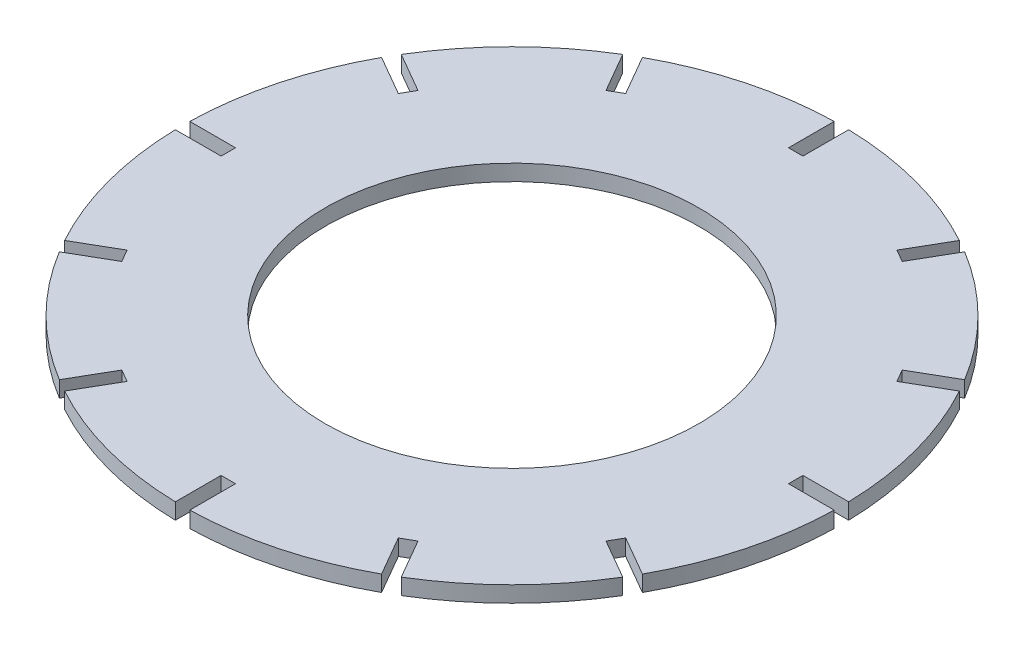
ISO-10303-21;
HEADER;
FILE_DESCRIPTION(('STEP AP214'),'2;1');
FILE_NAME('part.step','',(''),(''),'','','');
FILE_SCHEMA(('AUTOMOTIVE_DESIGN { 1 0 10303 214 1 1 1 1 }'));
ENDSEC;
DATA;
#1=APPLICATION_CONTEXT('core data for automotive mechanical design processes');
#2=APPLICATION_PROTOCOL_DEFINITION('international standard','automotive_design',2000,#1);
#3=PRODUCT_CONTEXT('',#1,'mechanical');
#4=PRODUCT('Part','Part','',(#3));
#5=PRODUCT_RELATED_PRODUCT_CATEGORY('part','',(#4));
#6=PRODUCT_DEFINITION_FORMATION('','',#4);
#7=PRODUCT_DEFINITION_CONTEXT('part definition',#1,'design');
#8=PRODUCT_DEFINITION('design','',#6,#7);
#9=PRODUCT_DEFINITION_SHAPE('','',#8);
#10=(LENGTH_UNIT() NAMED_UNIT(*) SI_UNIT(.MILLI.,.METRE.));
#11=(NAMED_UNIT(*) PLANE_ANGLE_UNIT() SI_UNIT($,.RADIAN.));
#12=(NAMED_UNIT(*) SI_UNIT($,.STERADIAN.) SOLID_ANGLE_UNIT());
#13=UNCERTAINTY_MEASURE_WITH_UNIT(LENGTH_MEASURE(1.E-05),#10,'distance_accuracy_value','');
#14=(GEOMETRIC_REPRESENTATION_CONTEXT(3) GLOBAL_UNCERTAINTY_ASSIGNED_CONTEXT((#13)) GLOBAL_UNIT_ASSIGNED_CONTEXT((#10,
#11,#12)) REPRESENTATION_CONTEXT('',''));
#15=CARTESIAN_POINT('',(0.,0.,0.));
#16=DIRECTION('',(0.,0.,1.));
#17=DIRECTION('',(1.,0.,0.));
#18=AXIS2_PLACEMENT_3D('',#15,#16,#17);
#19=CARTESIAN_POINT('',(0.,3.,0.));
#20=DIRECTION('',(0.,1.,0.));
#21=DIRECTION('',(0.,0.,1.));
#22=AXIS2_PLACEMENT_3D('',#19,#20,#21);
#23=PLANE('',#22);
#24=CARTESIAN_POINT('',(0.,3.,0.));
#25=DIRECTION('',(0.,1.,0.));
#26=DIRECTION('',(0.,0.,1.));
#27=AXIS2_PLACEMENT_3D('',#24,#25,#26);
#28=CIRCLE('',#27,61.69);
#29=CARTESIAN_POINT('',(61.6752267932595,3.,-1.35));
#30=VERTEX_POINT('',#29);
#31=CARTESIAN_POINT('',(54.0873131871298,3.,-29.6684791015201));
#32=VERTEX_POINT('',#31);
#33=EDGE_CURVE('E469',#30,#32,#28,.T.);
#34=ORIENTED_EDGE('',*,*,#33,.T.);
#35=DIRECTION('',(-0.866025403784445,0.,0.499999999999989));
#36=VECTOR('',#35,1.);
#37=CARTESIAN_POINT('',(46.674135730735,3.,-25.3884791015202));
#38=LINE('',#37,#36);
#39=CARTESIAN_POINT('',(46.674135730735,3.,-25.3884791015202));
#40=VERTEX_POINT('',#39);
#41=EDGE_CURVE('E217',#32,#40,#38,.T.);
#42=ORIENTED_EDGE('',*,*,#41,.T.);
#43=DIRECTION('',(-0.499999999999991,0.,-0.866025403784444));
#44=VECTOR('',#43,1.);
#45=CARTESIAN_POINT('',(46.674135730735,3.,-25.3884791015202));
#46=LINE('',#45,#44);
#47=CARTESIAN_POINT('',(45.324135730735,3.,-27.7267476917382));
#48=VERTEX_POINT('',#47);
#49=EDGE_CURVE('E604',#40,#48,#46,.T.);
#50=ORIENTED_EDGE('',*,*,#49,.T.);
#51=DIRECTION('',(0.866025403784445,0.,-0.499999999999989));
#52=VECTOR('',#51,1.);
#53=CARTESIAN_POINT('',(45.324135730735,3.,-27.7267476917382));
#54=LINE('',#53,#52);
#55=CARTESIAN_POINT('',(52.7373131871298,3.,-32.0067476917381));
#56=VERTEX_POINT('',#55);
#57=EDGE_CURVE('E623',#48,#56,#54,.T.);
#58=ORIENTED_EDGE('',*,*,#57,.T.);
#59=CARTESIAN_POINT('',(0.,3.,0.));
#60=DIRECTION('',(0.,1.,0.));
#61=DIRECTION('',(0.,0.,1.));
#62=AXIS2_PLACEMENT_3D('',#59,#60,#61);
#63=CIRCLE('',#62,61.69);
#64=CARTESIAN_POINT('',(32.0067476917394,3.,-52.737313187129));
#65=VERTEX_POINT('',#64);
#66=EDGE_CURVE('E620',#56,#65,#63,.T.);
#67=ORIENTED_EDGE('',*,*,#66,.T.);
#68=DIRECTION('',(-0.500000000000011,0.,0.866025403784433));
#69=VECTOR('',#68,1.);
#70=CARTESIAN_POINT('',(27.7267476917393,3.,-45.3241357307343));
#71=LINE('',#70,#69);
#72=CARTESIAN_POINT('',(27.7267476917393,3.,-45.3241357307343));
#73=VERTEX_POINT('',#72);
#74=EDGE_CURVE('E622',#65,#73,#71,.T.);
#75=ORIENTED_EDGE('',*,*,#74,.T.);
#76=DIRECTION('',(-0.866025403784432,0.,-0.500000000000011));
#77=VECTOR('',#76,1.);
#78=CARTESIAN_POINT('',(27.7267476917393,3.,-45.3241357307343));
#79=LINE('',#78,#77);
#80=CARTESIAN_POINT('',(25.3884791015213,3.,-46.6741357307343));
#81=VERTEX_POINT('',#80);
#82=EDGE_CURVE('E625',#73,#81,#79,.T.);
#83=ORIENTED_EDGE('',*,*,#82,.T.);
#84=DIRECTION('',(0.50000000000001,0.,-0.866025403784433));
#85=VECTOR('',#84,1.);
#86=CARTESIAN_POINT('',(25.3884791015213,3.,-46.6741357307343));
#87=LINE('',#86,#85);
#88=CARTESIAN_POINT('',(29.6684791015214,3.,-54.0873131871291));
#89=VERTEX_POINT('',#88);
#90=EDGE_CURVE('E631',#81,#89,#87,.T.);
#91=ORIENTED_EDGE('',*,*,#90,.T.);
#92=CARTESIAN_POINT('',(0.,3.,0.));
#93=DIRECTION('',(0.,1.,0.));
#94=DIRECTION('',(0.,0.,1.));
#95=AXIS2_PLACEMENT_3D('',#92,#93,#94);
#96=CIRCLE('',#95,61.69);
#97=CARTESIAN_POINT('',(1.35000000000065,3.,-61.6752267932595));
#98=VERTEX_POINT('',#97);
#99=EDGE_CURVE('E633',#89,#98,#96,.T.);
#100=ORIENTED_EDGE('',*,*,#99,.T.);
#101=DIRECTION('',(0.,0.,1.));
#102=VECTOR('',#101,1.);
#103=CARTESIAN_POINT('',(1.35000000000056,3.,-53.1152267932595));
#104=LINE('',#103,#102);
#105=CARTESIAN_POINT('',(1.35000000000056,3.,-53.1152267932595));
#106=VERTEX_POINT('',#105);
#107=EDGE_CURVE('E635',#98,#106,#104,.T.);
#108=ORIENTED_EDGE('',*,*,#107,.T.);
#109=DIRECTION('',(-1.,0.,0.));
#110=VECTOR('',#109,1.);
#111=CARTESIAN_POINT('',(1.35000000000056,3.,-53.1152267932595));
#112=LINE('',#111,#110);
#113=CARTESIAN_POINT('',(-1.34999999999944,3.,-53.1152267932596));
#114=VERTEX_POINT('',#113);
#115=EDGE_CURVE('E637',#106,#114,#112,.T.);
#116=ORIENTED_EDGE('',*,*,#115,.T.);
#117=DIRECTION('',(0.,0.,-1.));
#118=VECTOR('',#117,1.);
#119=CARTESIAN_POINT('',(-1.34999999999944,3.,-53.1152267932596));
#120=LINE('',#119,#118);
#121=CARTESIAN_POINT('',(-1.34999999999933,3.,-61.6752267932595));
#122=VERTEX_POINT('',#121);
#123=EDGE_CURVE('E639',#114,#122,#120,.T.);
#124=ORIENTED_EDGE('',*,*,#123,.T.);
#125=CARTESIAN_POINT('',(0.,3.,0.));
#126=DIRECTION('',(0.,1.,0.));
#127=DIRECTION('',(0.,0.,1.));
#128=AXIS2_PLACEMENT_3D('',#125,#126,#127);
#129=CIRCLE('',#128,61.69);
#130=CARTESIAN_POINT('',(-29.6684791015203,3.,-54.0873131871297));
#131=VERTEX_POINT('',#130);
#132=EDGE_CURVE('E641',#122,#131,#129,.T.);
#133=ORIENTED_EDGE('',*,*,#132,.T.);
#134=DIRECTION('',(0.499999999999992,0.,0.866025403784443));
#135=VECTOR('',#134,1.);
#136=CARTESIAN_POINT('',(-25.3884791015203,3.,-46.6741357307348));
#137=LINE('',#136,#135);
#138=CARTESIAN_POINT('',(-25.3884791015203,3.,-46.6741357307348));
#139=VERTEX_POINT('',#138);
#140=EDGE_CURVE('E643',#131,#139,#137,.T.);
#141=ORIENTED_EDGE('',*,*,#140,.T.);
#142=DIRECTION('',(-0.866025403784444,0.,0.499999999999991));
#143=VECTOR('',#142,1.);
#144=CARTESIAN_POINT('',(-25.3884791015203,3.,-46.6741357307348));
#145=LINE('',#144,#143);
#146=CARTESIAN_POINT('',(-27.7267476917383,3.,-45.3241357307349));
#147=VERTEX_POINT('',#146);
#148=EDGE_CURVE('E645',#139,#147,#145,.T.);
#149=ORIENTED_EDGE('',*,*,#148,.T.);
#150=DIRECTION('',(-0.499999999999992,0.,-0.866025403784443));
#151=VECTOR('',#150,1.);
#152=CARTESIAN_POINT('',(-27.7267476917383,3.,-45.3241357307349));
#153=LINE('',#152,#151);
#154=CARTESIAN_POINT('',(-32.0067476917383,3.,-52.7373131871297));
#155=VERTEX_POINT('',#154);
#156=EDGE_CURVE('E647',#147,#155,#153,.T.);
#157=ORIENTED_EDGE('',*,*,#156,.T.);
#158=CARTESIAN_POINT('',(0.,3.,0.));
#159=DIRECTION('',(0.,1.,0.));
#160=DIRECTION('',(0.,0.,1.));
#161=AXIS2_PLACEMENT_3D('',#158,#159,#160);
#162=CIRCLE('',#161,61.69);
#163=CARTESIAN_POINT('',(-52.7373131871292,3.,-32.0067476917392));
#164=VERTEX_POINT('',#163);
#165=EDGE_CURVE('E649',#155,#164,#162,.T.);
#166=ORIENTED_EDGE('',*,*,#165,.T.);
#167=DIRECTION('',(0.866025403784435,0.,0.500000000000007));
#168=VECTOR('',#167,1.);
#169=CARTESIAN_POINT('',(-45.3241357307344,3.,-27.7267476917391));
#170=LINE('',#169,#168);
#171=CARTESIAN_POINT('',(-45.3241357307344,3.,-27.7267476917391));
#172=VERTEX_POINT('',#171);
#173=EDGE_CURVE('E651',#164,#172,#170,.T.);
#174=ORIENTED_EDGE('',*,*,#173,.T.);
#175=DIRECTION('',(-0.500000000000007,0.,0.866025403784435));
#176=VECTOR('',#175,1.);
#177=CARTESIAN_POINT('',(-45.3241357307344,3.,-27.7267476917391));
#178=LINE('',#177,#176);
#179=CARTESIAN_POINT('',(-46.6741357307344,3.,-25.3884791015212));
#180=VERTEX_POINT('',#179);
#181=EDGE_CURVE('E653',#172,#180,#178,.T.);
#182=ORIENTED_EDGE('',*,*,#181,.T.);
#183=DIRECTION('',(-0.866025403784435,0.,-0.500000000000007));
#184=VECTOR('',#183,1.);
#185=CARTESIAN_POINT('',(-46.6741357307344,3.,-25.3884791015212));
#186=LINE('',#185,#184);
#187=CARTESIAN_POINT('',(-54.0873131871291,3.,-29.6684791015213));
#188=VERTEX_POINT('',#187);
#189=EDGE_CURVE('E655',#180,#188,#186,.T.);
#190=ORIENTED_EDGE('',*,*,#189,.T.);
#191=CARTESIAN_POINT('',(0.,3.,0.));
#192=DIRECTION('',(0.,1.,0.));
#193=DIRECTION('',(0.,0.,1.));
#194=AXIS2_PLACEMENT_3D('',#191,#192,#193);
#195=CIRCLE('',#194,61.69);
#196=CARTESIAN_POINT('',(-61.6752267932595,3.,-1.35000000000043));
#197=VERTEX_POINT('',#196);
#198=EDGE_CURVE('E657',#188,#197,#195,.T.);
#199=ORIENTED_EDGE('',*,*,#198,.T.);
#200=DIRECTION('',(1.,0.,0.));
#201=VECTOR('',#200,1.);
#202=CARTESIAN_POINT('',(-53.1152267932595,3.,-1.35000000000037));
#203=LINE('',#202,#201);
#204=CARTESIAN_POINT('',(-53.1152267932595,3.,-1.35000000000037));
#205=VERTEX_POINT('',#204);
#206=EDGE_CURVE('E659',#197,#205,#203,.T.);
#207=ORIENTED_EDGE('',*,*,#206,.T.);
#208=DIRECTION('',(0.,0.,1.));
#209=VECTOR('',#208,1.);
#210=CARTESIAN_POINT('',(-53.1152267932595,3.,-1.35000000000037));
#211=LINE('',#210,#209);
#212=CARTESIAN_POINT('',(-53.1152267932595,3.,1.34999999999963));
#213=VERTEX_POINT('',#212);
#214=EDGE_CURVE('E661',#205,#213,#211,.T.);
#215=ORIENTED_EDGE('',*,*,#214,.T.);
#216=DIRECTION('',(-1.,0.,0.));
#217=VECTOR('',#216,1.);
#218=CARTESIAN_POINT('',(-53.1152267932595,3.,1.34999999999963));
#219=LINE('',#218,#217);
#220=CARTESIAN_POINT('',(-61.6752267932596,3.,1.34999999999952));
#221=VERTEX_POINT('',#220);
#222=EDGE_CURVE('E663',#213,#221,#219,.T.);
#223=ORIENTED_EDGE('',*,*,#222,.T.);
#224=CARTESIAN_POINT('',(0.,3.,0.));
#225=DIRECTION('',(0.,1.,0.));
#226=DIRECTION('',(0.,0.,1.));
#227=AXIS2_PLACEMENT_3D('',#224,#225,#226);
#228=CIRCLE('',#227,61.69);
#229=CARTESIAN_POINT('',(-54.0873131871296,3.,29.6684791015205));
#230=VERTEX_POINT('',#229);
#231=EDGE_CURVE('E665',#221,#230,#228,.T.);
#232=ORIENTED_EDGE('',*,*,#231,.T.);
#233=DIRECTION('',(0.866025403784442,0.,-0.499999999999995));
#234=VECTOR('',#233,1.);
#235=CARTESIAN_POINT('',(-46.6741357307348,3.,25.3884791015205));
#236=LINE('',#235,#234);
#237=CARTESIAN_POINT('',(-46.6741357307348,3.,25.3884791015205));
#238=VERTEX_POINT('',#237);
#239=EDGE_CURVE('E667',#230,#238,#236,.T.);
#240=ORIENTED_EDGE('',*,*,#239,.T.);
#241=DIRECTION('',(0.499999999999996,0.,0.866025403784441));
#242=VECTOR('',#241,1.);
#243=CARTESIAN_POINT('',(-46.6741357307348,3.,25.3884791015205));
#244=LINE('',#243,#242);
#245=CARTESIAN_POINT('',(-45.3241357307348,3.,27.7267476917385));
#246=VERTEX_POINT('',#245);
#247=EDGE_CURVE('E669',#238,#246,#244,.T.);
#248=ORIENTED_EDGE('',*,*,#247,.T.);
#249=DIRECTION('',(-0.866025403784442,0.,0.499999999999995));
#250=VECTOR('',#249,1.);
#251=CARTESIAN_POINT('',(-45.3241357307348,3.,27.7267476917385));
#252=LINE('',#251,#250);
#253=CARTESIAN_POINT('',(-52.7373131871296,3.,32.0067476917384));
#254=VERTEX_POINT('',#253);
#255=EDGE_CURVE('E671',#246,#254,#252,.T.);
#256=ORIENTED_EDGE('',*,*,#255,.T.);
#257=CARTESIAN_POINT('',(0.,3.,0.));
#258=DIRECTION('',(0.,1.,0.));
#259=DIRECTION('',(0.,0.,1.));
#260=AXIS2_PLACEMENT_3D('',#257,#258,#259);
#261=CIRCLE('',#260,61.69);
#262=CARTESIAN_POINT('',(-32.006747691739,3.,52.7373131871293));
#263=VERTEX_POINT('',#262);
#264=EDGE_CURVE('E673',#254,#263,#261,.T.);
#265=ORIENTED_EDGE('',*,*,#264,.T.);
#266=DIRECTION('',(0.500000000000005,0.,-0.866025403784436));
#267=VECTOR('',#266,1.);
#268=CARTESIAN_POINT('',(-27.726747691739,3.,45.3241357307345));
#269=LINE('',#268,#267);
#270=CARTESIAN_POINT('',(-27.726747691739,3.,45.3241357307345));
#271=VERTEX_POINT('',#270);
#272=EDGE_CURVE('E675',#263,#271,#269,.T.);
#273=ORIENTED_EDGE('',*,*,#272,.T.);
#274=DIRECTION('',(0.866025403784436,0.,0.500000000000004));
#275=VECTOR('',#274,1.);
#276=CARTESIAN_POINT('',(-27.726747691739,3.,45.3241357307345));
#277=LINE('',#276,#275);
#278=CARTESIAN_POINT('',(-25.388479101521,3.,46.6741357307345));
#279=VERTEX_POINT('',#278);
#280=EDGE_CURVE('E677',#271,#279,#277,.T.);
#281=ORIENTED_EDGE('',*,*,#280,.T.);
#282=DIRECTION('',(-0.500000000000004,0.,0.866025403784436));
#283=VECTOR('',#282,1.);
#284=CARTESIAN_POINT('',(-25.388479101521,3.,46.6741357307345));
#285=LINE('',#284,#283);
#286=CARTESIAN_POINT('',(-29.668479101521,3.,54.0873131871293));
#287=VERTEX_POINT('',#286);
#288=EDGE_CURVE('E679',#279,#287,#285,.T.);
#289=ORIENTED_EDGE('',*,*,#288,.T.);
#290=CARTESIAN_POINT('',(0.,3.,0.));
#291=DIRECTION('',(0.,1.,0.));
#292=DIRECTION('',(0.,0.,1.));
#293=AXIS2_PLACEMENT_3D('',#290,#291,#292);
#294=CIRCLE('',#293,61.69);
#295=CARTESIAN_POINT('',(-1.35000000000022,3.,61.6752267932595));
#296=VERTEX_POINT('',#295);
#297=EDGE_CURVE('E681',#287,#296,#294,.T.);
#298=ORIENTED_EDGE('',*,*,#297,.T.);
#299=DIRECTION('',(0.,0.,-1.));
#300=VECTOR('',#299,1.);
#301=CARTESIAN_POINT('',(-1.35000000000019,3.,53.1152267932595));
#302=LINE('',#301,#300);
#303=CARTESIAN_POINT('',(-1.35000000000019,3.,53.1152267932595));
#304=VERTEX_POINT('',#303);
#305=EDGE_CURVE('E683',#296,#304,#302,.T.);
#306=ORIENTED_EDGE('',*,*,#305,.T.);
#307=DIRECTION('',(1.,0.,0.));
#308=VECTOR('',#307,1.);
#309=CARTESIAN_POINT('',(-1.35000000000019,3.,53.1152267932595));
#310=LINE('',#309,#308);
#311=CARTESIAN_POINT('',(1.34999999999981,3.,53.1152267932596));
#312=VERTEX_POINT('',#311);
#313=EDGE_CURVE('E685',#304,#312,#310,.T.);
#314=ORIENTED_EDGE('',*,*,#313,.T.);
#315=DIRECTION('',(0.,0.,1.));
#316=VECTOR('',#315,1.);
#317=CARTESIAN_POINT('',(1.34999999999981,3.,53.1152267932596));
#318=LINE('',#317,#316);
#319=CARTESIAN_POINT('',(1.34999999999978,3.,61.6752267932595));
#320=VERTEX_POINT('',#319);
#321=EDGE_CURVE('E687',#312,#320,#318,.T.);
#322=ORIENTED_EDGE('',*,*,#321,.T.);
#323=CARTESIAN_POINT('',(0.,3.,0.));
#324=DIRECTION('',(0.,1.,0.));
#325=DIRECTION('',(0.,0.,1.));
#326=AXIS2_PLACEMENT_3D('',#323,#324,#325);
#327=CIRCLE('',#326,61.69);
#328=CARTESIAN_POINT('',(29.6684791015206,3.,54.0873131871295));
#329=VERTEX_POINT('',#328);
#330=EDGE_CURVE('E689',#320,#329,#327,.T.);
#331=ORIENTED_EDGE('',*,*,#330,.T.);
#332=DIRECTION('',(-0.499999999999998,0.,-0.86602540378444));
#333=VECTOR('',#332,1.);
#334=CARTESIAN_POINT('',(25.3884791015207,3.,46.6741357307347));
#335=LINE('',#334,#333);
#336=CARTESIAN_POINT('',(25.3884791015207,3.,46.6741357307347));
#337=VERTEX_POINT('',#336);
#338=EDGE_CURVE('E691',#329,#337,#335,.T.);
#339=ORIENTED_EDGE('',*,*,#338,.T.);
#340=DIRECTION('',(0.86602540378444,0.,-0.499999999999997));
#341=VECTOR('',#340,1.);
#342=CARTESIAN_POINT('',(25.3884791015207,3.,46.6741357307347));
#343=LINE('',#342,#341);
#344=CARTESIAN_POINT('',(27.7267476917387,3.,45.3241357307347));
#345=VERTEX_POINT('',#344);
#346=EDGE_CURVE('E693',#337,#345,#343,.T.);
#347=ORIENTED_EDGE('',*,*,#346,.T.);
#348=DIRECTION('',(0.499999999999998,0.,0.86602540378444));
#349=VECTOR('',#348,1.);
#350=CARTESIAN_POINT('',(27.7267476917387,3.,45.3241357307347));
#351=LINE('',#350,#349);
#352=CARTESIAN_POINT('',(32.0067476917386,3.,52.7373131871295));
#353=VERTEX_POINT('',#352);
#354=EDGE_CURVE('E695',#345,#353,#351,.T.);
#355=ORIENTED_EDGE('',*,*,#354,.T.);
#356=CARTESIAN_POINT('',(0.,3.,0.));
#357=DIRECTION('',(0.,1.,0.));
#358=DIRECTION('',(0.,0.,1.));
#359=AXIS2_PLACEMENT_3D('',#356,#357,#358);
#360=CIRCLE('',#359,61.69);
#361=CARTESIAN_POINT('',(52.7373131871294,3.,32.0067476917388));
#362=VERTEX_POINT('',#361);
#363=EDGE_CURVE('E697',#353,#362,#360,.T.);
#364=ORIENTED_EDGE('',*,*,#363,.T.);
#365=DIRECTION('',(-0.866025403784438,0.,-0.500000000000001));
#366=VECTOR('',#365,1.);
#367=CARTESIAN_POINT('',(45.3241357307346,3.,27.7267476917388));
#368=LINE('',#367,#366);
#369=CARTESIAN_POINT('',(45.3241357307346,3.,27.7267476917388));
#370=VERTEX_POINT('',#369);
#371=EDGE_CURVE('E699',#362,#370,#368,.T.);
#372=ORIENTED_EDGE('',*,*,#371,.T.);
#373=DIRECTION('',(0.500000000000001,0.,-0.866025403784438));
#374=VECTOR('',#373,1.);
#375=CARTESIAN_POINT('',(45.3241357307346,3.,27.7267476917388));
#376=LINE('',#375,#374);
#377=CARTESIAN_POINT('',(46.6741357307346,3.,25.3884791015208));
#378=VERTEX_POINT('',#377);
#379=EDGE_CURVE('E701',#370,#378,#376,.T.);
#380=ORIENTED_EDGE('',*,*,#379,.T.);
#381=DIRECTION('',(0.866025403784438,0.,0.500000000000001));
#382=VECTOR('',#381,1.);
#383=CARTESIAN_POINT('',(46.6741357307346,3.,25.3884791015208));
#384=LINE('',#383,#382);
#385=CARTESIAN_POINT('',(54.0873131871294,3.,29.6684791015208));
#386=VERTEX_POINT('',#385);
#387=EDGE_CURVE('E703',#378,#386,#384,.T.);
#388=ORIENTED_EDGE('',*,*,#387,.T.);
#389=CARTESIAN_POINT('',(0.,3.,0.));
#390=DIRECTION('',(0.,1.,0.));
#391=DIRECTION('',(0.,0.,1.));
#392=AXIS2_PLACEMENT_3D('',#389,#390,#391);
#393=CIRCLE('',#392,61.69);
#394=CARTESIAN_POINT('',(61.6752267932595,3.,1.35));
#395=VERTEX_POINT('',#394);
#396=EDGE_CURVE('E356',#386,#395,#393,.T.);
#397=ORIENTED_EDGE('',*,*,#396,.T.);
#398=DIRECTION('',(-1.,0.,0.));
#399=VECTOR('',#398,1.);
#400=CARTESIAN_POINT('',(53.1152267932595,3.,1.35));
#401=LINE('',#400,#399);
#402=CARTESIAN_POINT('',(53.1152267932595,3.,1.35));
#403=VERTEX_POINT('',#402);
#404=EDGE_CURVE('E350',#395,#403,#401,.T.);
#405=ORIENTED_EDGE('',*,*,#404,.T.);
#406=DIRECTION('',(0.,0.,-1.));
#407=VECTOR('',#406,1.);
#408=CARTESIAN_POINT('',(53.1152267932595,3.,1.35));
#409=LINE('',#408,#407);
#410=CARTESIAN_POINT('',(53.1152267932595,3.,-1.35));
#411=VERTEX_POINT('',#410);
#412=EDGE_CURVE('E354',#403,#411,#409,.T.);
#413=ORIENTED_EDGE('',*,*,#412,.T.);
#414=DIRECTION('',(1.,0.,0.));
#415=VECTOR('',#414,1.);
#416=CARTESIAN_POINT('',(53.1152267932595,3.,-1.35));
#417=LINE('',#416,#415);
#418=EDGE_CURVE('E54',#411,#30,#417,.T.);
#419=ORIENTED_EDGE('',*,*,#418,.T.);
#420=EDGE_LOOP('',(#34,#42,#50,#58,#67,#75,#83,#91,#100,#108,#116,#124,#133,#141,#149,#157,#166,
#174,#182,#190,#199,#207,#215,#223,#232,#240,#248,#256,#265,#273,#281,#289,#298,#306,#314,#322,
#331,#339,#347,#355,#364,#372,#380,#388,#397,#405,#413,#419));
#421=FACE_BOUND('',#420,.T.);
#422=CARTESIAN_POINT('',(0.,3.,0.));
#423=DIRECTION('',(0.,1.,0.));
#424=DIRECTION('',(0.,0.,1.));
#425=AXIS2_PLACEMENT_3D('',#422,#423,#424);
#426=CIRCLE('',#425,35.);
#427=CARTESIAN_POINT('',(0.,3.,35.));
#428=VERTEX_POINT('',#427);
#429=EDGE_CURVE('E378',#428,#428,#426,.T.);
#430=ORIENTED_EDGE('',*,*,#429,.F.);
#431=EDGE_LOOP('',(#430));
#432=FACE_BOUND('',#431,.T.);
#433=ADVANCED_FACE('F37',(#421,#432),#23,.T.);
#434=CARTESIAN_POINT('',(0.,0.,0.));
#435=DIRECTION('',(0.,1.,0.));
#436=DIRECTION('',(0.,0.,1.));
#437=AXIS2_PLACEMENT_3D('',#434,#435,#436);
#438=PLANE('',#437);
#439=CARTESIAN_POINT('',(0.,0.,0.));
#440=DIRECTION('',(0.,1.,0.));
#441=DIRECTION('',(0.,0.,1.));
#442=AXIS2_PLACEMENT_3D('',#439,#440,#441);
#443=CIRCLE('',#442,61.69);
#444=CARTESIAN_POINT('',(61.6752267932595,0.,-1.35));
#445=VERTEX_POINT('',#444);
#446=CARTESIAN_POINT('',(54.0873131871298,0.,-29.6684791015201));
#447=VERTEX_POINT('',#446);
#448=EDGE_CURVE('E374',#445,#447,#443,.T.);
#449=ORIENTED_EDGE('',*,*,#448,.F.);
#450=DIRECTION('',(1.,0.,0.));
#451=VECTOR('',#450,1.);
#452=CARTESIAN_POINT('',(53.1152267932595,0.,-1.35));
#453=LINE('',#452,#451);
#454=CARTESIAN_POINT('',(53.1152267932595,0.,-1.35));
#455=VERTEX_POINT('',#454);
#456=EDGE_CURVE('E209',#455,#445,#453,.T.);
#457=ORIENTED_EDGE('',*,*,#456,.F.);
#458=DIRECTION('',(0.,0.,-1.));
#459=VECTOR('',#458,1.);
#460=CARTESIAN_POINT('',(53.1152267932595,0.,1.35));
#461=LINE('',#460,#459);
#462=CARTESIAN_POINT('',(53.1152267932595,0.,1.35));
#463=VERTEX_POINT('',#462);
#464=EDGE_CURVE('E203',#463,#455,#461,.T.);
#465=ORIENTED_EDGE('',*,*,#464,.F.);
#466=DIRECTION('',(-1.,0.,0.));
#467=VECTOR('',#466,1.);
#468=CARTESIAN_POINT('',(53.1152267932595,0.,1.35));
#469=LINE('',#468,#467);
#470=CARTESIAN_POINT('',(61.6752267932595,0.,1.35));
#471=VERTEX_POINT('',#470);
#472=EDGE_CURVE('E364',#471,#463,#469,.T.);
#473=ORIENTED_EDGE('',*,*,#472,.F.);
#474=CARTESIAN_POINT('',(0.,0.,0.));
#475=DIRECTION('',(0.,1.,0.));
#476=DIRECTION('',(0.,0.,1.));
#477=AXIS2_PLACEMENT_3D('',#474,#475,#476);
#478=CIRCLE('',#477,61.69);
#479=CARTESIAN_POINT('',(54.0873131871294,0.,29.6684791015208));
#480=VERTEX_POINT('',#479);
#481=EDGE_CURVE('E464',#480,#471,#478,.T.);
#482=ORIENTED_EDGE('',*,*,#481,.F.);
#483=DIRECTION('',(0.866025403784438,0.,0.500000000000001));
#484=VECTOR('',#483,1.);
#485=CARTESIAN_POINT('',(46.6741357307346,0.,25.3884791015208));
#486=LINE('',#485,#484);
#487=CARTESIAN_POINT('',(46.6741357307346,0.,25.3884791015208));
#488=VERTEX_POINT('',#487);
#489=EDGE_CURVE('E462',#488,#480,#486,.T.);
#490=ORIENTED_EDGE('',*,*,#489,.F.);
#491=DIRECTION('',(0.500000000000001,0.,-0.866025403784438));
#492=VECTOR('',#491,1.);
#493=CARTESIAN_POINT('',(45.3241357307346,0.,27.7267476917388));
#494=LINE('',#493,#492);
#495=CARTESIAN_POINT('',(45.3241357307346,0.,27.7267476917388));
#496=VERTEX_POINT('',#495);
#497=EDGE_CURVE('E460',#496,#488,#494,.T.);
#498=ORIENTED_EDGE('',*,*,#497,.F.);
#499=DIRECTION('',(-0.866025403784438,0.,-0.500000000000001));
#500=VECTOR('',#499,1.);
#501=CARTESIAN_POINT('',(45.3241357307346,0.,27.7267476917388));
#502=LINE('',#501,#500);
#503=CARTESIAN_POINT('',(52.7373131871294,0.,32.0067476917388));
#504=VERTEX_POINT('',#503);
#505=EDGE_CURVE('E458',#504,#496,#502,.T.);
#506=ORIENTED_EDGE('',*,*,#505,.F.);
#507=CARTESIAN_POINT('',(0.,0.,0.));
#508=DIRECTION('',(0.,1.,0.));
#509=DIRECTION('',(0.,0.,1.));
#510=AXIS2_PLACEMENT_3D('',#507,#508,#509);
#511=CIRCLE('',#510,61.69);
#512=CARTESIAN_POINT('',(32.0067476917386,0.,52.7373131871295));
#513=VERTEX_POINT('',#512);
#514=EDGE_CURVE('E456',#513,#504,#511,.T.);
#515=ORIENTED_EDGE('',*,*,#514,.F.);
#516=DIRECTION('',(0.499999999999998,0.,0.86602540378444));
#517=VECTOR('',#516,1.);
#518=CARTESIAN_POINT('',(27.7267476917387,0.,45.3241357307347));
#519=LINE('',#518,#517);
#520=CARTESIAN_POINT('',(27.7267476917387,0.,45.3241357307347));
#521=VERTEX_POINT('',#520);
#522=EDGE_CURVE('E454',#521,#513,#519,.T.);
#523=ORIENTED_EDGE('',*,*,#522,.F.);
#524=DIRECTION('',(0.86602540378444,0.,-0.499999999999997));
#525=VECTOR('',#524,1.);
#526=CARTESIAN_POINT('',(25.3884791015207,0.,46.6741357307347));
#527=LINE('',#526,#525);
#528=CARTESIAN_POINT('',(25.3884791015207,0.,46.6741357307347));
#529=VERTEX_POINT('',#528);
#530=EDGE_CURVE('E452',#529,#521,#527,.T.);
#531=ORIENTED_EDGE('',*,*,#530,.F.);
#532=DIRECTION('',(-0.499999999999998,0.,-0.86602540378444));
#533=VECTOR('',#532,1.);
#534=CARTESIAN_POINT('',(25.3884791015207,0.,46.6741357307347));
#535=LINE('',#534,#533);
#536=CARTESIAN_POINT('',(29.6684791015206,0.,54.0873131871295));
#537=VERTEX_POINT('',#536);
#538=EDGE_CURVE('E450',#537,#529,#535,.T.);
#539=ORIENTED_EDGE('',*,*,#538,.F.);
#540=CARTESIAN_POINT('',(0.,0.,0.));
#541=DIRECTION('',(0.,1.,0.));
#542=DIRECTION('',(0.,0.,1.));
#543=AXIS2_PLACEMENT_3D('',#540,#541,#542);
#544=CIRCLE('',#543,61.69);
#545=CARTESIAN_POINT('',(1.34999999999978,0.,61.6752267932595));
#546=VERTEX_POINT('',#545);
#547=EDGE_CURVE('E448',#546,#537,#544,.T.);
#548=ORIENTED_EDGE('',*,*,#547,.F.);
#549=DIRECTION('',(0.,0.,1.));
#550=VECTOR('',#549,1.);
#551=CARTESIAN_POINT('',(1.34999999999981,0.,53.1152267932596));
#552=LINE('',#551,#550);
#553=CARTESIAN_POINT('',(1.34999999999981,0.,53.1152267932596));
#554=VERTEX_POINT('',#553);
#555=EDGE_CURVE('E446',#554,#546,#552,.T.);
#556=ORIENTED_EDGE('',*,*,#555,.F.);
#557=DIRECTION('',(1.,0.,0.));
#558=VECTOR('',#557,1.);
#559=CARTESIAN_POINT('',(-1.35000000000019,0.,53.1152267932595));
#560=LINE('',#559,#558);
#561=CARTESIAN_POINT('',(-1.35000000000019,0.,53.1152267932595));
#562=VERTEX_POINT('',#561);
#563=EDGE_CURVE('E444',#562,#554,#560,.T.);
#564=ORIENTED_EDGE('',*,*,#563,.F.);
#565=DIRECTION('',(0.,0.,-1.));
#566=VECTOR('',#565,1.);
#567=CARTESIAN_POINT('',(-1.35000000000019,0.,53.1152267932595));
#568=LINE('',#567,#566);
#569=CARTESIAN_POINT('',(-1.35000000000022,0.,61.6752267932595));
#570=VERTEX_POINT('',#569);
#571=EDGE_CURVE('E442',#570,#562,#568,.T.);
#572=ORIENTED_EDGE('',*,*,#571,.F.);
#573=CARTESIAN_POINT('',(0.,0.,0.));
#574=DIRECTION('',(0.,1.,0.));
#575=DIRECTION('',(0.,0.,1.));
#576=AXIS2_PLACEMENT_3D('',#573,#574,#575);
#577=CIRCLE('',#576,61.69);
#578=CARTESIAN_POINT('',(-29.668479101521,0.,54.0873131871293));
#579=VERTEX_POINT('',#578);
#580=EDGE_CURVE('E440',#579,#570,#577,.T.);
#581=ORIENTED_EDGE('',*,*,#580,.F.);
#582=DIRECTION('',(-0.500000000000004,0.,0.866025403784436));
#583=VECTOR('',#582,1.);
#584=CARTESIAN_POINT('',(-25.388479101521,0.,46.6741357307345));
#585=LINE('',#584,#583);
#586=CARTESIAN_POINT('',(-25.388479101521,0.,46.6741357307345));
#587=VERTEX_POINT('',#586);
#588=EDGE_CURVE('E438',#587,#579,#585,.T.);
#589=ORIENTED_EDGE('',*,*,#588,.F.);
#590=DIRECTION('',(0.866025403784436,0.,0.500000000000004));
#591=VECTOR('',#590,1.);
#592=CARTESIAN_POINT('',(-27.726747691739,0.,45.3241357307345));
#593=LINE('',#592,#591);
#594=CARTESIAN_POINT('',(-27.726747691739,0.,45.3241357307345));
#595=VERTEX_POINT('',#594);
#596=EDGE_CURVE('E436',#595,#587,#593,.T.);
#597=ORIENTED_EDGE('',*,*,#596,.F.);
#598=DIRECTION('',(0.500000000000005,0.,-0.866025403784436));
#599=VECTOR('',#598,1.);
#600=CARTESIAN_POINT('',(-27.726747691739,0.,45.3241357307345));
#601=LINE('',#600,#599);
#602=CARTESIAN_POINT('',(-32.006747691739,0.,52.7373131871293));
#603=VERTEX_POINT('',#602);
#604=EDGE_CURVE('E434',#603,#595,#601,.T.);
#605=ORIENTED_EDGE('',*,*,#604,.F.);
#606=CARTESIAN_POINT('',(0.,0.,0.));
#607=DIRECTION('',(0.,1.,0.));
#608=DIRECTION('',(0.,0.,1.));
#609=AXIS2_PLACEMENT_3D('',#606,#607,#608);
#610=CIRCLE('',#609,61.69);
#611=CARTESIAN_POINT('',(-52.7373131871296,0.,32.0067476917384));
#612=VERTEX_POINT('',#611);
#613=EDGE_CURVE('E432',#612,#603,#610,.T.);
#614=ORIENTED_EDGE('',*,*,#613,.F.);
#615=DIRECTION('',(-0.866025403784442,0.,0.499999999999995));
#616=VECTOR('',#615,1.);
#617=CARTESIAN_POINT('',(-45.3241357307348,0.,27.7267476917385));
#618=LINE('',#617,#616);
#619=CARTESIAN_POINT('',(-45.3241357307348,0.,27.7267476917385));
#620=VERTEX_POINT('',#619);
#621=EDGE_CURVE('E430',#620,#612,#618,.T.);
#622=ORIENTED_EDGE('',*,*,#621,.F.);
#623=DIRECTION('',(0.499999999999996,0.,0.866025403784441));
#624=VECTOR('',#623,1.);
#625=CARTESIAN_POINT('',(-46.6741357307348,0.,25.3884791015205));
#626=LINE('',#625,#624);
#627=CARTESIAN_POINT('',(-46.6741357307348,0.,25.3884791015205));
#628=VERTEX_POINT('',#627);
#629=EDGE_CURVE('E428',#628,#620,#626,.T.);
#630=ORIENTED_EDGE('',*,*,#629,.F.);
#631=DIRECTION('',(0.866025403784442,0.,-0.499999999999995));
#632=VECTOR('',#631,1.);
#633=CARTESIAN_POINT('',(-46.6741357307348,0.,25.3884791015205));
#634=LINE('',#633,#632);
#635=CARTESIAN_POINT('',(-54.0873131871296,0.,29.6684791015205));
#636=VERTEX_POINT('',#635);
#637=EDGE_CURVE('E426',#636,#628,#634,.T.);
#638=ORIENTED_EDGE('',*,*,#637,.F.);
#639=CARTESIAN_POINT('',(0.,0.,0.));
#640=DIRECTION('',(0.,1.,0.));
#641=DIRECTION('',(0.,0.,1.));
#642=AXIS2_PLACEMENT_3D('',#639,#640,#641);
#643=CIRCLE('',#642,61.69);
#644=CARTESIAN_POINT('',(-61.6752267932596,0.,1.34999999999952));
#645=VERTEX_POINT('',#644);
#646=EDGE_CURVE('E424',#645,#636,#643,.T.);
#647=ORIENTED_EDGE('',*,*,#646,.F.);
#648=DIRECTION('',(-1.,0.,0.));
#649=VECTOR('',#648,1.);
#650=CARTESIAN_POINT('',(-53.1152267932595,0.,1.34999999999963));
#651=LINE('',#650,#649);
#652=CARTESIAN_POINT('',(-53.1152267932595,0.,1.34999999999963));
#653=VERTEX_POINT('',#652);
#654=EDGE_CURVE('E422',#653,#645,#651,.T.);
#655=ORIENTED_EDGE('',*,*,#654,.F.);
#656=DIRECTION('',(0.,0.,1.));
#657=VECTOR('',#656,1.);
#658=CARTESIAN_POINT('',(-53.1152267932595,0.,-1.35000000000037));
#659=LINE('',#658,#657);
#660=CARTESIAN_POINT('',(-53.1152267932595,0.,-1.35000000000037));
#661=VERTEX_POINT('',#660);
#662=EDGE_CURVE('E420',#661,#653,#659,.T.);
#663=ORIENTED_EDGE('',*,*,#662,.F.);
#664=DIRECTION('',(1.,0.,0.));
#665=VECTOR('',#664,1.);
#666=CARTESIAN_POINT('',(-53.1152267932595,0.,-1.35000000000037));
#667=LINE('',#666,#665);
#668=CARTESIAN_POINT('',(-61.6752267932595,0.,-1.35000000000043));
#669=VERTEX_POINT('',#668);
#670=EDGE_CURVE('E418',#669,#661,#667,.T.);
#671=ORIENTED_EDGE('',*,*,#670,.F.);
#672=CARTESIAN_POINT('',(0.,0.,0.));
#673=DIRECTION('',(0.,1.,0.));
#674=DIRECTION('',(0.,0.,1.));
#675=AXIS2_PLACEMENT_3D('',#672,#673,#674);
#676=CIRCLE('',#675,61.69);
#677=CARTESIAN_POINT('',(-54.0873131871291,0.,-29.6684791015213));
#678=VERTEX_POINT('',#677);
#679=EDGE_CURVE('E416',#678,#669,#676,.T.);
#680=ORIENTED_EDGE('',*,*,#679,.F.);
#681=DIRECTION('',(-0.866025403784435,0.,-0.500000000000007));
#682=VECTOR('',#681,1.);
#683=CARTESIAN_POINT('',(-46.6741357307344,0.,-25.3884791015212));
#684=LINE('',#683,#682);
#685=CARTESIAN_POINT('',(-46.6741357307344,0.,-25.3884791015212));
#686=VERTEX_POINT('',#685);
#687=EDGE_CURVE('E414',#686,#678,#684,.T.);
#688=ORIENTED_EDGE('',*,*,#687,.F.);
#689=DIRECTION('',(-0.500000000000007,0.,0.866025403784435));
#690=VECTOR('',#689,1.);
#691=CARTESIAN_POINT('',(-45.3241357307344,0.,-27.7267476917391));
#692=LINE('',#691,#690);
#693=CARTESIAN_POINT('',(-45.3241357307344,0.,-27.7267476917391));
#694=VERTEX_POINT('',#693);
#695=EDGE_CURVE('E412',#694,#686,#692,.T.);
#696=ORIENTED_EDGE('',*,*,#695,.F.);
#697=DIRECTION('',(0.866025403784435,0.,0.500000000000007));
#698=VECTOR('',#697,1.);
#699=CARTESIAN_POINT('',(-45.3241357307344,0.,-27.7267476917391));
#700=LINE('',#699,#698);
#701=CARTESIAN_POINT('',(-52.7373131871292,0.,-32.0067476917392));
#702=VERTEX_POINT('',#701);
#703=EDGE_CURVE('E410',#702,#694,#700,.T.);
#704=ORIENTED_EDGE('',*,*,#703,.F.);
#705=CARTESIAN_POINT('',(0.,0.,0.));
#706=DIRECTION('',(0.,1.,0.));
#707=DIRECTION('',(0.,0.,1.));
#708=AXIS2_PLACEMENT_3D('',#705,#706,#707);
#709=CIRCLE('',#708,61.69);
#710=CARTESIAN_POINT('',(-32.0067476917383,0.,-52.7373131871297));
#711=VERTEX_POINT('',#710);
#712=EDGE_CURVE('E408',#711,#702,#709,.T.);
#713=ORIENTED_EDGE('',*,*,#712,.F.);
#714=DIRECTION('',(-0.499999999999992,0.,-0.866025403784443));
#715=VECTOR('',#714,1.);
#716=CARTESIAN_POINT('',(-27.7267476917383,0.,-45.3241357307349));
#717=LINE('',#716,#715);
#718=CARTESIAN_POINT('',(-27.7267476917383,0.,-45.3241357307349));
#719=VERTEX_POINT('',#718);
#720=EDGE_CURVE('E406',#719,#711,#717,.T.);
#721=ORIENTED_EDGE('',*,*,#720,.F.);
#722=DIRECTION('',(-0.866025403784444,0.,0.499999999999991));
#723=VECTOR('',#722,1.);
#724=CARTESIAN_POINT('',(-25.3884791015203,0.,-46.6741357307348));
#725=LINE('',#724,#723);
#726=CARTESIAN_POINT('',(-25.3884791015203,0.,-46.6741357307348));
#727=VERTEX_POINT('',#726);
#728=EDGE_CURVE('E404',#727,#719,#725,.T.);
#729=ORIENTED_EDGE('',*,*,#728,.F.);
#730=DIRECTION('',(0.499999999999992,0.,0.866025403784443));
#731=VECTOR('',#730,1.);
#732=CARTESIAN_POINT('',(-25.3884791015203,0.,-46.6741357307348));
#733=LINE('',#732,#731);
#734=CARTESIAN_POINT('',(-29.6684791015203,0.,-54.0873131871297));
#735=VERTEX_POINT('',#734);
#736=EDGE_CURVE('E402',#735,#727,#733,.T.);
#737=ORIENTED_EDGE('',*,*,#736,.F.);
#738=CARTESIAN_POINT('',(0.,0.,0.));
#739=DIRECTION('',(0.,1.,0.));
#740=DIRECTION('',(0.,0.,1.));
#741=AXIS2_PLACEMENT_3D('',#738,#739,#740);
#742=CIRCLE('',#741,61.69);
#743=CARTESIAN_POINT('',(-1.34999999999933,0.,-61.6752267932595));
#744=VERTEX_POINT('',#743);
#745=EDGE_CURVE('E400',#744,#735,#742,.T.);
#746=ORIENTED_EDGE('',*,*,#745,.F.);
#747=DIRECTION('',(0.,0.,-1.));
#748=VECTOR('',#747,1.);
#749=CARTESIAN_POINT('',(-1.34999999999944,0.,-53.1152267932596));
#750=LINE('',#749,#748);
#751=CARTESIAN_POINT('',(-1.34999999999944,0.,-53.1152267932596));
#752=VERTEX_POINT('',#751);
#753=EDGE_CURVE('E398',#752,#744,#750,.T.);
#754=ORIENTED_EDGE('',*,*,#753,.F.);
#755=DIRECTION('',(-1.,0.,0.));
#756=VECTOR('',#755,1.);
#757=CARTESIAN_POINT('',(1.35000000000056,0.,-53.1152267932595));
#758=LINE('',#757,#756);
#759=CARTESIAN_POINT('',(1.35000000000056,0.,-53.1152267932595));
#760=VERTEX_POINT('',#759);
#761=EDGE_CURVE('E396',#760,#752,#758,.T.);
#762=ORIENTED_EDGE('',*,*,#761,.F.);
#763=DIRECTION('',(0.,0.,1.));
#764=VECTOR('',#763,1.);
#765=CARTESIAN_POINT('',(1.35000000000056,0.,-53.1152267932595));
#766=LINE('',#765,#764);
#767=CARTESIAN_POINT('',(1.35000000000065,0.,-61.6752267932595));
#768=VERTEX_POINT('',#767);
#769=EDGE_CURVE('E394',#768,#760,#766,.T.);
#770=ORIENTED_EDGE('',*,*,#769,.F.);
#771=CARTESIAN_POINT('',(0.,0.,0.));
#772=DIRECTION('',(0.,1.,0.));
#773=DIRECTION('',(0.,0.,1.));
#774=AXIS2_PLACEMENT_3D('',#771,#772,#773);
#775=CIRCLE('',#774,61.69);
#776=CARTESIAN_POINT('',(29.6684791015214,0.,-54.0873131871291));
#777=VERTEX_POINT('',#776);
#778=EDGE_CURVE('E392',#777,#768,#775,.T.);
#779=ORIENTED_EDGE('',*,*,#778,.F.);
#780=DIRECTION('',(0.50000000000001,0.,-0.866025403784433));
#781=VECTOR('',#780,1.);
#782=CARTESIAN_POINT('',(25.3884791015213,0.,-46.6741357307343));
#783=LINE('',#782,#781);
#784=CARTESIAN_POINT('',(25.3884791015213,0.,-46.6741357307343));
#785=VERTEX_POINT('',#784);
#786=EDGE_CURVE('E390',#785,#777,#783,.T.);
#787=ORIENTED_EDGE('',*,*,#786,.F.);
#788=DIRECTION('',(-0.866025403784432,0.,-0.500000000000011));
#789=VECTOR('',#788,1.);
#790=CARTESIAN_POINT('',(27.7267476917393,0.,-45.3241357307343));
#791=LINE('',#790,#789);
#792=CARTESIAN_POINT('',(27.7267476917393,0.,-45.3241357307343));
#793=VERTEX_POINT('',#792);
#794=EDGE_CURVE('E388',#793,#785,#791,.T.);
#795=ORIENTED_EDGE('',*,*,#794,.F.);
#796=DIRECTION('',(-0.500000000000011,0.,0.866025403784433));
#797=VECTOR('',#796,1.);
#798=CARTESIAN_POINT('',(27.7267476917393,0.,-45.3241357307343));
#799=LINE('',#798,#797);
#800=CARTESIAN_POINT('',(32.0067476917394,0.,-52.737313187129));
#801=VERTEX_POINT('',#800);
#802=EDGE_CURVE('E386',#801,#793,#799,.T.);
#803=ORIENTED_EDGE('',*,*,#802,.F.);
#804=CARTESIAN_POINT('',(0.,0.,0.));
#805=DIRECTION('',(0.,1.,0.));
#806=DIRECTION('',(0.,0.,1.));
#807=AXIS2_PLACEMENT_3D('',#804,#805,#806);
#808=CIRCLE('',#807,61.69);
#809=CARTESIAN_POINT('',(52.7373131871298,0.,-32.0067476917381));
#810=VERTEX_POINT('',#809);
#811=EDGE_CURVE('E384',#810,#801,#808,.T.);
#812=ORIENTED_EDGE('',*,*,#811,.F.);
#813=DIRECTION('',(0.866025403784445,0.,-0.499999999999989));
#814=VECTOR('',#813,1.);
#815=CARTESIAN_POINT('',(45.324135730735,0.,-27.7267476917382));
#816=LINE('',#815,#814);
#817=CARTESIAN_POINT('',(45.324135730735,0.,-27.7267476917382));
#818=VERTEX_POINT('',#817);
#819=EDGE_CURVE('E382',#818,#810,#816,.T.);
#820=ORIENTED_EDGE('',*,*,#819,.F.);
#821=DIRECTION('',(-0.499999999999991,0.,-0.866025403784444));
#822=VECTOR('',#821,1.);
#823=CARTESIAN_POINT('',(46.674135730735,0.,-25.3884791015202));
#824=LINE('',#823,#822);
#825=CARTESIAN_POINT('',(46.674135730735,0.,-25.3884791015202));
#826=VERTEX_POINT('',#825);
#827=EDGE_CURVE('E380',#826,#818,#824,.T.);
#828=ORIENTED_EDGE('',*,*,#827,.F.);
#829=DIRECTION('',(-0.866025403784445,0.,0.499999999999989));
#830=VECTOR('',#829,1.);
#831=CARTESIAN_POINT('',(46.674135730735,0.,-25.3884791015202));
#832=LINE('',#831,#830);
#833=EDGE_CURVE('E377',#447,#826,#832,.T.);
#834=ORIENTED_EDGE('',*,*,#833,.F.);
#835=EDGE_LOOP('',(#449,#457,#465,#473,#482,#490,#498,#506,#515,#523,#531,#539,#548,#556,#564,
#572,#581,#589,#597,#605,#614,#622,#630,#638,#647,#655,#663,#671,#680,#688,#696,#704,#713,#721,
#729,#737,#746,#754,#762,#770,#779,#787,#795,#803,#812,#820,#828,#834));
#836=FACE_BOUND('',#835,.T.);
#837=CARTESIAN_POINT('',(0.,0.,0.));
#838=DIRECTION('',(0.,1.,0.));
#839=DIRECTION('',(0.,0.,1.));
#840=AXIS2_PLACEMENT_3D('',#837,#838,#839);
#841=CIRCLE('',#840,35.);
#842=CARTESIAN_POINT('',(0.,0.,35.));
#843=VERTEX_POINT('',#842);
#844=EDGE_CURVE('E1420',#843,#843,#841,.T.);
#845=ORIENTED_EDGE('',*,*,#844,.T.);
#846=EDGE_LOOP('',(#845));
#847=FACE_BOUND('',#846,.T.);
#848=ADVANCED_FACE('F608',(#836,#847),#438,.F.);
#849=CARTESIAN_POINT('',(0.,3.,0.));
#850=DIRECTION('',(0.,-1.,0.));
#851=DIRECTION('',(0.,0.,-1.));
#852=AXIS2_PLACEMENT_3D('',#849,#850,#851);
#853=CYLINDRICAL_SURFACE('',#852,61.69);
#854=ORIENTED_EDGE('',*,*,#448,.T.);
#855=DIRECTION('',(0.,-1.,0.));
#856=VECTOR('',#855,1.);
#857=CARTESIAN_POINT('',(54.0873131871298,3.,-29.6684791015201));
#858=LINE('',#857,#856);
#859=EDGE_CURVE('E11',#32,#447,#858,.T.);
#860=ORIENTED_EDGE('',*,*,#859,.F.);
#861=ORIENTED_EDGE('',*,*,#33,.F.);
#862=DIRECTION('',(0.,-1.,0.));
#863=VECTOR('',#862,1.);
#864=CARTESIAN_POINT('',(61.6752267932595,3.,-1.35));
#865=LINE('',#864,#863);
#866=EDGE_CURVE('E370',#30,#445,#865,.T.);
#867=ORIENTED_EDGE('',*,*,#866,.T.);
#868=EDGE_LOOP('',(#854,#860,#861,#867));
#869=FACE_BOUND('',#868,.T.);
#870=ADVANCED_FACE('F39',(#869),#853,.T.);
#871=CARTESIAN_POINT('',(46.674135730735,3.,-25.3884791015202));
#872=DIRECTION('',(0.499999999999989,0.,0.866025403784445));
#873=DIRECTION('',(0.866025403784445,0.,-0.499999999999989));
#874=AXIS2_PLACEMENT_3D('',#871,#872,#873);
#875=PLANE('',#874);
#876=ORIENTED_EDGE('',*,*,#833,.T.);
#877=DIRECTION('',(0.,-1.,0.));
#878=VECTOR('',#877,1.);
#879=CARTESIAN_POINT('',(46.674135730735,3.,-25.3884791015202));
#880=LINE('',#879,#878);
#881=EDGE_CURVE('E46',#40,#826,#880,.T.);
#882=ORIENTED_EDGE('',*,*,#881,.F.);
#883=ORIENTED_EDGE('',*,*,#41,.F.);
#884=ORIENTED_EDGE('',*,*,#859,.T.);
#885=EDGE_LOOP('',(#876,#882,#883,#884));
#886=FACE_BOUND('',#885,.T.);
#887=ADVANCED_FACE('F737',(#886),#875,.F.);
#888=CARTESIAN_POINT('',(46.674135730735,3.,-25.3884791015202));
#889=DIRECTION('',(-0.866025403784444,0.,0.499999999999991));
#890=DIRECTION('',(0.499999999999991,0.,0.866025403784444));
#891=AXIS2_PLACEMENT_3D('',#888,#889,#890);
#892=PLANE('',#891);
#893=ORIENTED_EDGE('',*,*,#827,.T.);
#894=DIRECTION('',(0.,-1.,0.));
#895=VECTOR('',#894,1.);
#896=CARTESIAN_POINT('',(45.324135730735,3.,-27.7267476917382));
#897=LINE('',#896,#895);
#898=EDGE_CURVE('E596',#48,#818,#897,.T.);
#899=ORIENTED_EDGE('',*,*,#898,.F.);
#900=ORIENTED_EDGE('',*,*,#49,.F.);
#901=ORIENTED_EDGE('',*,*,#881,.T.);
#902=EDGE_LOOP('',(#893,#899,#900,#901));
#903=FACE_BOUND('',#902,.T.);
#904=ADVANCED_FACE('F602',(#903),#892,.F.);
#905=CARTESIAN_POINT('',(45.324135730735,3.,-27.7267476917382));
#906=DIRECTION('',(-0.499999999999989,0.,-0.866025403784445));
#907=DIRECTION('',(-0.866025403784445,0.,0.499999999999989));
#908=AXIS2_PLACEMENT_3D('',#905,#906,#907);
#909=PLANE('',#908);
#910=ORIENTED_EDGE('',*,*,#819,.T.);
#911=DIRECTION('',(0.,-1.,0.));
#912=VECTOR('',#911,1.);
#913=CARTESIAN_POINT('',(52.7373131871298,3.,-32.0067476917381));
#914=LINE('',#913,#912);
#915=EDGE_CURVE('E593',#56,#810,#914,.T.);
#916=ORIENTED_EDGE('',*,*,#915,.F.);
#917=ORIENTED_EDGE('',*,*,#57,.F.);
#918=ORIENTED_EDGE('',*,*,#898,.T.);
#919=EDGE_LOOP('',(#910,#916,#917,#918));
#920=FACE_BOUND('',#919,.T.);
#921=ADVANCED_FACE('F614',(#920),#909,.F.);
#922=CARTESIAN_POINT('',(0.,3.,0.));
#923=DIRECTION('',(0.,-1.,0.));
#924=DIRECTION('',(0.,0.,-1.));
#925=AXIS2_PLACEMENT_3D('',#922,#923,#924);
#926=CYLINDRICAL_SURFACE('',#925,61.69);
#927=ORIENTED_EDGE('',*,*,#811,.T.);
#928=DIRECTION('',(0.,-1.,0.));
#929=VECTOR('',#928,1.);
#930=CARTESIAN_POINT('',(32.0067476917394,3.,-52.737313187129));
#931=LINE('',#930,#929);
#932=EDGE_CURVE('E590',#65,#801,#931,.T.);
#933=ORIENTED_EDGE('',*,*,#932,.F.);
#934=ORIENTED_EDGE('',*,*,#66,.F.);
#935=ORIENTED_EDGE('',*,*,#915,.T.);
#936=EDGE_LOOP('',(#927,#933,#934,#935));
#937=FACE_BOUND('',#936,.T.);
#938=ADVANCED_FACE('F618',(#937),#926,.T.);
#939=CARTESIAN_POINT('',(27.7267476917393,3.,-45.3241357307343));
#940=DIRECTION('',(0.866025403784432,0.,0.500000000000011));
#941=DIRECTION('',(0.500000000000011,0.,-0.866025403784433));
#942=AXIS2_PLACEMENT_3D('',#939,#940,#941);
#943=PLANE('',#942);
#944=ORIENTED_EDGE('',*,*,#802,.T.);
#945=DIRECTION('',(0.,-1.,0.));
#946=VECTOR('',#945,1.);
#947=CARTESIAN_POINT('',(27.7267476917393,3.,-45.3241357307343));
#948=LINE('',#947,#946);
#949=EDGE_CURVE('E587',#73,#793,#948,.T.);
#950=ORIENTED_EDGE('',*,*,#949,.F.);
#951=ORIENTED_EDGE('',*,*,#74,.F.);
#952=ORIENTED_EDGE('',*,*,#932,.T.);
#953=EDGE_LOOP('',(#944,#950,#951,#952));
#954=FACE_BOUND('',#953,.T.);
#955=ADVANCED_FACE('F750',(#954),#943,.F.);
#956=CARTESIAN_POINT('',(27.7267476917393,3.,-45.3241357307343));
#957=DIRECTION('',(-0.500000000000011,0.,0.866025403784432));
#958=DIRECTION('',(0.866025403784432,0.,0.500000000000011));
#959=AXIS2_PLACEMENT_3D('',#956,#957,#958);
#960=PLANE('',#959);
#961=ORIENTED_EDGE('',*,*,#794,.T.);
#962=DIRECTION('',(0.,-1.,0.));
#963=VECTOR('',#962,1.);
#964=CARTESIAN_POINT('',(25.3884791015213,3.,-46.6741357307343));
#965=LINE('',#964,#963);
#966=EDGE_CURVE('E584',#81,#785,#965,.T.);
#967=ORIENTED_EDGE('',*,*,#966,.F.);
#968=ORIENTED_EDGE('',*,*,#82,.F.);
#969=ORIENTED_EDGE('',*,*,#949,.T.);
#970=EDGE_LOOP('',(#961,#967,#968,#969));
#971=FACE_BOUND('',#970,.T.);
#972=ADVANCED_FACE('F753',(#971),#960,.F.);
#973=CARTESIAN_POINT('',(25.3884791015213,3.,-46.6741357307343));
#974=DIRECTION('',(-0.866025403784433,0.,-0.50000000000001));
#975=DIRECTION('',(-0.50000000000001,0.,0.866025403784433));
#976=AXIS2_PLACEMENT_3D('',#973,#974,#975);
#977=PLANE('',#976);
#978=ORIENTED_EDGE('',*,*,#786,.T.);
#979=DIRECTION('',(0.,-1.,0.));
#980=VECTOR('',#979,1.);
#981=CARTESIAN_POINT('',(29.6684791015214,3.,-54.0873131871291));
#982=LINE('',#981,#980);
#983=EDGE_CURVE('E581',#89,#777,#982,.T.);
#984=ORIENTED_EDGE('',*,*,#983,.F.);
#985=ORIENTED_EDGE('',*,*,#90,.F.);
#986=ORIENTED_EDGE('',*,*,#966,.T.);
#987=EDGE_LOOP('',(#978,#984,#985,#986));
#988=FACE_BOUND('',#987,.T.);
#989=ADVANCED_FACE('F757',(#988),#977,.F.);
#990=CARTESIAN_POINT('',(0.,3.,0.));
#991=DIRECTION('',(0.,-1.,0.));
#992=DIRECTION('',(0.,0.,-1.));
#993=AXIS2_PLACEMENT_3D('',#990,#991,#992);
#994=CYLINDRICAL_SURFACE('',#993,61.69);
#995=ORIENTED_EDGE('',*,*,#778,.T.);
#996=DIRECTION('',(0.,-1.,0.));
#997=VECTOR('',#996,1.);
#998=CARTESIAN_POINT('',(1.35000000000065,3.,-61.6752267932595));
#999=LINE('',#998,#997);
#1000=EDGE_CURVE('E578',#98,#768,#999,.T.);
#1001=ORIENTED_EDGE('',*,*,#1000,.F.);
#1002=ORIENTED_EDGE('',*,*,#99,.F.);
#1003=ORIENTED_EDGE('',*,*,#983,.T.);
#1004=EDGE_LOOP('',(#995,#1001,#1002,#1003));
#1005=FACE_BOUND('',#1004,.T.);
#1006=ADVANCED_FACE('F761',(#1005),#994,.T.);
#1007=CARTESIAN_POINT('',(1.35000000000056,3.,-53.1152267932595));
#1008=DIRECTION('',(1.,0.,0.));
#1009=DIRECTION('',(0.,0.,-1.));
#1010=AXIS2_PLACEMENT_3D('',#1007,#1008,#1009);
#1011=PLANE('',#1010);
#1012=ORIENTED_EDGE('',*,*,#769,.T.);
#1013=DIRECTION('',(0.,-1.,0.));
#1014=VECTOR('',#1013,1.);
#1015=CARTESIAN_POINT('',(1.35000000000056,3.,-53.1152267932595));
#1016=LINE('',#1015,#1014);
#1017=EDGE_CURVE('E575',#106,#760,#1016,.T.);
#1018=ORIENTED_EDGE('',*,*,#1017,.F.);
#1019=ORIENTED_EDGE('',*,*,#107,.F.);
#1020=ORIENTED_EDGE('',*,*,#1000,.T.);
#1021=EDGE_LOOP('',(#1012,#1018,#1019,#1020));
#1022=FACE_BOUND('',#1021,.T.);
#1023=ADVANCED_FACE('F765',(#1022),#1011,.F.);
#1024=CARTESIAN_POINT('',(1.35000000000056,3.,-53.1152267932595));
#1025=DIRECTION('',(0.,0.,1.));
#1026=DIRECTION('',(1.,0.,0.));
#1027=AXIS2_PLACEMENT_3D('',#1024,#1025,#1026);
#1028=PLANE('',#1027);
#1029=ORIENTED_EDGE('',*,*,#761,.T.);
#1030=DIRECTION('',(0.,-1.,0.));
#1031=VECTOR('',#1030,1.);
#1032=CARTESIAN_POINT('',(-1.34999999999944,3.,-53.1152267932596));
#1033=LINE('',#1032,#1031);
#1034=EDGE_CURVE('E572',#114,#752,#1033,.T.);
#1035=ORIENTED_EDGE('',*,*,#1034,.F.);
#1036=ORIENTED_EDGE('',*,*,#115,.F.);
#1037=ORIENTED_EDGE('',*,*,#1017,.T.);
#1038=EDGE_LOOP('',(#1029,#1035,#1036,#1037));
#1039=FACE_BOUND('',#1038,.T.);
#1040=ADVANCED_FACE('F769',(#1039),#1028,.F.);
#1041=CARTESIAN_POINT('',(-1.34999999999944,3.,-53.1152267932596));
#1042=DIRECTION('',(-1.,0.,0.));
#1043=DIRECTION('',(0.,0.,1.));
#1044=AXIS2_PLACEMENT_3D('',#1041,#1042,#1043);
#1045=PLANE('',#1044);
#1046=ORIENTED_EDGE('',*,*,#753,.T.);
#1047=DIRECTION('',(0.,-1.,0.));
#1048=VECTOR('',#1047,1.);
#1049=CARTESIAN_POINT('',(-1.34999999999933,3.,-61.6752267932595));
#1050=LINE('',#1049,#1048);
#1051=EDGE_CURVE('E569',#122,#744,#1050,.T.);
#1052=ORIENTED_EDGE('',*,*,#1051,.F.);
#1053=ORIENTED_EDGE('',*,*,#123,.F.);
#1054=ORIENTED_EDGE('',*,*,#1034,.T.);
#1055=EDGE_LOOP('',(#1046,#1052,#1053,#1054));
#1056=FACE_BOUND('',#1055,.T.);
#1057=ADVANCED_FACE('F773',(#1056),#1045,.F.);
#1058=CARTESIAN_POINT('',(0.,3.,0.));
#1059=DIRECTION('',(0.,-1.,0.));
#1060=DIRECTION('',(0.,0.,-1.));
#1061=AXIS2_PLACEMENT_3D('',#1058,#1059,#1060);
#1062=CYLINDRICAL_SURFACE('',#1061,61.69);
#1063=ORIENTED_EDGE('',*,*,#745,.T.);
#1064=DIRECTION('',(0.,-1.,0.));
#1065=VECTOR('',#1064,1.);
#1066=CARTESIAN_POINT('',(-29.6684791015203,3.,-54.0873131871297));
#1067=LINE('',#1066,#1065);
#1068=EDGE_CURVE('E566',#131,#735,#1067,.T.);
#1069=ORIENTED_EDGE('',*,*,#1068,.F.);
#1070=ORIENTED_EDGE('',*,*,#132,.F.);
#1071=ORIENTED_EDGE('',*,*,#1051,.T.);
#1072=EDGE_LOOP('',(#1063,#1069,#1070,#1071));
#1073=FACE_BOUND('',#1072,.T.);
#1074=ADVANCED_FACE('F777',(#1073),#1062,.T.);
#1075=CARTESIAN_POINT('',(-25.3884791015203,3.,-46.6741357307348));
#1076=DIRECTION('',(0.866025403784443,0.,-0.499999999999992));
#1077=DIRECTION('',(-0.499999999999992,0.,-0.866025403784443));
#1078=AXIS2_PLACEMENT_3D('',#1075,#1076,#1077);
#1079=PLANE('',#1078);
#1080=ORIENTED_EDGE('',*,*,#736,.T.);
#1081=DIRECTION('',(0.,-1.,0.));
#1082=VECTOR('',#1081,1.);
#1083=CARTESIAN_POINT('',(-25.3884791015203,3.,-46.6741357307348));
#1084=LINE('',#1083,#1082);
#1085=EDGE_CURVE('E563',#139,#727,#1084,.T.);
#1086=ORIENTED_EDGE('',*,*,#1085,.F.);
#1087=ORIENTED_EDGE('',*,*,#140,.F.);
#1088=ORIENTED_EDGE('',*,*,#1068,.T.);
#1089=EDGE_LOOP('',(#1080,#1086,#1087,#1088));
#1090=FACE_BOUND('',#1089,.T.);
#1091=ADVANCED_FACE('F781',(#1090),#1079,.F.);
#1092=CARTESIAN_POINT('',(-25.3884791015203,3.,-46.6741357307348));
#1093=DIRECTION('',(0.499999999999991,0.,0.866025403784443));
#1094=DIRECTION('',(0.866025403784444,0.,-0.499999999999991));
#1095=AXIS2_PLACEMENT_3D('',#1092,#1093,#1094);
#1096=PLANE('',#1095);
#1097=ORIENTED_EDGE('',*,*,#728,.T.);
#1098=DIRECTION('',(0.,-1.,0.));
#1099=VECTOR('',#1098,1.);
#1100=CARTESIAN_POINT('',(-27.7267476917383,3.,-45.3241357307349));
#1101=LINE('',#1100,#1099);
#1102=EDGE_CURVE('E560',#147,#719,#1101,.T.);
#1103=ORIENTED_EDGE('',*,*,#1102,.F.);
#1104=ORIENTED_EDGE('',*,*,#148,.F.);
#1105=ORIENTED_EDGE('',*,*,#1085,.T.);
#1106=EDGE_LOOP('',(#1097,#1103,#1104,#1105));
#1107=FACE_BOUND('',#1106,.T.);
#1108=ADVANCED_FACE('F785',(#1107),#1096,.F.);
#1109=CARTESIAN_POINT('',(-27.7267476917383,3.,-45.3241357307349));
#1110=DIRECTION('',(-0.866025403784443,0.,0.499999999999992));
#1111=DIRECTION('',(0.499999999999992,0.,0.866025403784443));
#1112=AXIS2_PLACEMENT_3D('',#1109,#1110,#1111);
#1113=PLANE('',#1112);
#1114=ORIENTED_EDGE('',*,*,#720,.T.);
#1115=DIRECTION('',(0.,-1.,0.));
#1116=VECTOR('',#1115,1.);
#1117=CARTESIAN_POINT('',(-32.0067476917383,3.,-52.7373131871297));
#1118=LINE('',#1117,#1116);
#1119=EDGE_CURVE('E557',#155,#711,#1118,.T.);
#1120=ORIENTED_EDGE('',*,*,#1119,.F.);
#1121=ORIENTED_EDGE('',*,*,#156,.F.);
#1122=ORIENTED_EDGE('',*,*,#1102,.T.);
#1123=EDGE_LOOP('',(#1114,#1120,#1121,#1122));
#1124=FACE_BOUND('',#1123,.T.);
#1125=ADVANCED_FACE('F789',(#1124),#1113,.F.);
#1126=CARTESIAN_POINT('',(0.,3.,0.));
#1127=DIRECTION('',(0.,-1.,0.));
#1128=DIRECTION('',(0.,0.,-1.));
#1129=AXIS2_PLACEMENT_3D('',#1126,#1127,#1128);
#1130=CYLINDRICAL_SURFACE('',#1129,61.69);
#1131=ORIENTED_EDGE('',*,*,#712,.T.);
#1132=DIRECTION('',(0.,-1.,0.));
#1133=VECTOR('',#1132,1.);
#1134=CARTESIAN_POINT('',(-52.7373131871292,3.,-32.0067476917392));
#1135=LINE('',#1134,#1133);
#1136=EDGE_CURVE('E554',#164,#702,#1135,.T.);
#1137=ORIENTED_EDGE('',*,*,#1136,.F.);
#1138=ORIENTED_EDGE('',*,*,#165,.F.);
#1139=ORIENTED_EDGE('',*,*,#1119,.T.);
#1140=EDGE_LOOP('',(#1131,#1137,#1138,#1139));
#1141=FACE_BOUND('',#1140,.T.);
#1142=ADVANCED_FACE('F793',(#1141),#1130,.T.);
#1143=CARTESIAN_POINT('',(-45.3241357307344,3.,-27.7267476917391));
#1144=DIRECTION('',(0.500000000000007,0.,-0.866025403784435));
#1145=DIRECTION('',(-0.866025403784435,0.,-0.500000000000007));
#1146=AXIS2_PLACEMENT_3D('',#1143,#1144,#1145);
#1147=PLANE('',#1146);
#1148=ORIENTED_EDGE('',*,*,#703,.T.);
#1149=DIRECTION('',(0.,-1.,0.));
#1150=VECTOR('',#1149,1.);
#1151=CARTESIAN_POINT('',(-45.3241357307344,3.,-27.7267476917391));
#1152=LINE('',#1151,#1150);
#1153=EDGE_CURVE('E551',#172,#694,#1152,.T.);
#1154=ORIENTED_EDGE('',*,*,#1153,.F.);
#1155=ORIENTED_EDGE('',*,*,#173,.F.);
#1156=ORIENTED_EDGE('',*,*,#1136,.T.);
#1157=EDGE_LOOP('',(#1148,#1154,#1155,#1156));
#1158=FACE_BOUND('',#1157,.T.);
#1159=ADVANCED_FACE('F797',(#1158),#1147,.F.);
#1160=CARTESIAN_POINT('',(-45.3241357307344,3.,-27.7267476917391));
#1161=DIRECTION('',(0.866025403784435,0.,0.500000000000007));
#1162=DIRECTION('',(0.500000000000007,0.,-0.866025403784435));
#1163=AXIS2_PLACEMENT_3D('',#1160,#1161,#1162);
#1164=PLANE('',#1163);
#1165=ORIENTED_EDGE('',*,*,#695,.T.);
#1166=DIRECTION('',(0.,-1.,0.));
#1167=VECTOR('',#1166,1.);
#1168=CARTESIAN_POINT('',(-46.6741357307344,3.,-25.3884791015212));
#1169=LINE('',#1168,#1167);
#1170=EDGE_CURVE('E548',#180,#686,#1169,.T.);
#1171=ORIENTED_EDGE('',*,*,#1170,.F.);
#1172=ORIENTED_EDGE('',*,*,#181,.F.);
#1173=ORIENTED_EDGE('',*,*,#1153,.T.);
#1174=EDGE_LOOP('',(#1165,#1171,#1172,#1173));
#1175=FACE_BOUND('',#1174,.T.);
#1176=ADVANCED_FACE('F801',(#1175),#1164,.F.);
#1177=CARTESIAN_POINT('',(-46.6741357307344,3.,-25.3884791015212));
#1178=DIRECTION('',(-0.500000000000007,0.,0.866025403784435));
#1179=DIRECTION('',(0.866025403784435,0.,0.500000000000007));
#1180=AXIS2_PLACEMENT_3D('',#1177,#1178,#1179);
#1181=PLANE('',#1180);
#1182=ORIENTED_EDGE('',*,*,#687,.T.);
#1183=DIRECTION('',(0.,-1.,0.));
#1184=VECTOR('',#1183,1.);
#1185=CARTESIAN_POINT('',(-54.0873131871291,3.,-29.6684791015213));
#1186=LINE('',#1185,#1184);
#1187=EDGE_CURVE('E545',#188,#678,#1186,.T.);
#1188=ORIENTED_EDGE('',*,*,#1187,.F.);
#1189=ORIENTED_EDGE('',*,*,#189,.F.);
#1190=ORIENTED_EDGE('',*,*,#1170,.T.);
#1191=EDGE_LOOP('',(#1182,#1188,#1189,#1190));
#1192=FACE_BOUND('',#1191,.T.);
#1193=ADVANCED_FACE('F805',(#1192),#1181,.F.);
#1194=CARTESIAN_POINT('',(0.,3.,0.));
#1195=DIRECTION('',(0.,-1.,0.));
#1196=DIRECTION('',(0.,0.,-1.));
#1197=AXIS2_PLACEMENT_3D('',#1194,#1195,#1196);
#1198=CYLINDRICAL_SURFACE('',#1197,61.69);
#1199=ORIENTED_EDGE('',*,*,#679,.T.);
#1200=DIRECTION('',(0.,-1.,0.));
#1201=VECTOR('',#1200,1.);
#1202=CARTESIAN_POINT('',(-61.6752267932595,3.,-1.35000000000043));
#1203=LINE('',#1202,#1201);
#1204=EDGE_CURVE('E542',#197,#669,#1203,.T.);
#1205=ORIENTED_EDGE('',*,*,#1204,.F.);
#1206=ORIENTED_EDGE('',*,*,#198,.F.);
#1207=ORIENTED_EDGE('',*,*,#1187,.T.);
#1208=EDGE_LOOP('',(#1199,#1205,#1206,#1207));
#1209=FACE_BOUND('',#1208,.T.);
#1210=ADVANCED_FACE('F809',(#1209),#1198,.T.);
#1211=CARTESIAN_POINT('',(-53.1152267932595,3.,-1.35000000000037));
#1212=DIRECTION('',(0.,0.,-1.));
#1213=DIRECTION('',(-1.,0.,0.));
#1214=AXIS2_PLACEMENT_3D('',#1211,#1212,#1213);
#1215=PLANE('',#1214);
#1216=ORIENTED_EDGE('',*,*,#670,.T.);
#1217=DIRECTION('',(0.,-1.,0.));
#1218=VECTOR('',#1217,1.);
#1219=CARTESIAN_POINT('',(-53.1152267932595,3.,-1.35000000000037));
#1220=LINE('',#1219,#1218);
#1221=EDGE_CURVE('E539',#205,#661,#1220,.T.);
#1222=ORIENTED_EDGE('',*,*,#1221,.F.);
#1223=ORIENTED_EDGE('',*,*,#206,.F.);
#1224=ORIENTED_EDGE('',*,*,#1204,.T.);
#1225=EDGE_LOOP('',(#1216,#1222,#1223,#1224));
#1226=FACE_BOUND('',#1225,.T.);
#1227=ADVANCED_FACE('F813',(#1226),#1215,.F.);
#1228=CARTESIAN_POINT('',(-53.1152267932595,3.,-1.35000000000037));
#1229=DIRECTION('',(1.,0.,0.));
#1230=DIRECTION('',(0.,0.,-1.));
#1231=AXIS2_PLACEMENT_3D('',#1228,#1229,#1230);
#1232=PLANE('',#1231);
#1233=ORIENTED_EDGE('',*,*,#662,.T.);
#1234=DIRECTION('',(0.,-1.,0.));
#1235=VECTOR('',#1234,1.);
#1236=CARTESIAN_POINT('',(-53.1152267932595,3.,1.34999999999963));
#1237=LINE('',#1236,#1235);
#1238=EDGE_CURVE('E536',#213,#653,#1237,.T.);
#1239=ORIENTED_EDGE('',*,*,#1238,.F.);
#1240=ORIENTED_EDGE('',*,*,#214,.F.);
#1241=ORIENTED_EDGE('',*,*,#1221,.T.);
#1242=EDGE_LOOP('',(#1233,#1239,#1240,#1241));
#1243=FACE_BOUND('',#1242,.T.);
#1244=ADVANCED_FACE('F817',(#1243),#1232,.F.);
#1245=CARTESIAN_POINT('',(-53.1152267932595,3.,1.34999999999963));
#1246=DIRECTION('',(0.,0.,1.));
#1247=DIRECTION('',(1.,0.,0.));
#1248=AXIS2_PLACEMENT_3D('',#1245,#1246,#1247);
#1249=PLANE('',#1248);
#1250=ORIENTED_EDGE('',*,*,#654,.T.);
#1251=DIRECTION('',(0.,-1.,0.));
#1252=VECTOR('',#1251,1.);
#1253=CARTESIAN_POINT('',(-61.6752267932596,3.,1.34999999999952));
#1254=LINE('',#1253,#1252);
#1255=EDGE_CURVE('E533',#221,#645,#1254,.T.);
#1256=ORIENTED_EDGE('',*,*,#1255,.F.);
#1257=ORIENTED_EDGE('',*,*,#222,.F.);
#1258=ORIENTED_EDGE('',*,*,#1238,.T.);
#1259=EDGE_LOOP('',(#1250,#1256,#1257,#1258));
#1260=FACE_BOUND('',#1259,.T.);
#1261=ADVANCED_FACE('F821',(#1260),#1249,.F.);
#1262=CARTESIAN_POINT('',(0.,3.,0.));
#1263=DIRECTION('',(0.,-1.,0.));
#1264=DIRECTION('',(0.,0.,-1.));
#1265=AXIS2_PLACEMENT_3D('',#1262,#1263,#1264);
#1266=CYLINDRICAL_SURFACE('',#1265,61.69);
#1267=ORIENTED_EDGE('',*,*,#646,.T.);
#1268=DIRECTION('',(0.,-1.,0.));
#1269=VECTOR('',#1268,1.);
#1270=CARTESIAN_POINT('',(-54.0873131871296,3.,29.6684791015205));
#1271=LINE('',#1270,#1269);
#1272=EDGE_CURVE('E530',#230,#636,#1271,.T.);
#1273=ORIENTED_EDGE('',*,*,#1272,.F.);
#1274=ORIENTED_EDGE('',*,*,#231,.F.);
#1275=ORIENTED_EDGE('',*,*,#1255,.T.);
#1276=EDGE_LOOP('',(#1267,#1273,#1274,#1275));
#1277=FACE_BOUND('',#1276,.T.);
#1278=ADVANCED_FACE('F825',(#1277),#1266,.T.);
#1279=CARTESIAN_POINT('',(-46.6741357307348,3.,25.3884791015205));
#1280=DIRECTION('',(-0.499999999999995,0.,-0.866025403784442));
#1281=DIRECTION('',(-0.866025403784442,0.,0.499999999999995));
#1282=AXIS2_PLACEMENT_3D('',#1279,#1280,#1281);
#1283=PLANE('',#1282);
#1284=ORIENTED_EDGE('',*,*,#637,.T.);
#1285=DIRECTION('',(0.,-1.,0.));
#1286=VECTOR('',#1285,1.);
#1287=CARTESIAN_POINT('',(-46.6741357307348,3.,25.3884791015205));
#1288=LINE('',#1287,#1286);
#1289=EDGE_CURVE('E527',#238,#628,#1288,.T.);
#1290=ORIENTED_EDGE('',*,*,#1289,.F.);
#1291=ORIENTED_EDGE('',*,*,#239,.F.);
#1292=ORIENTED_EDGE('',*,*,#1272,.T.);
#1293=EDGE_LOOP('',(#1284,#1290,#1291,#1292));
#1294=FACE_BOUND('',#1293,.T.);
#1295=ADVANCED_FACE('F829',(#1294),#1283,.F.);
#1296=CARTESIAN_POINT('',(-46.6741357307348,3.,25.3884791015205));
#1297=DIRECTION('',(0.866025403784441,0.,-0.499999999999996));
#1298=DIRECTION('',(-0.499999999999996,0.,-0.866025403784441));
#1299=AXIS2_PLACEMENT_3D('',#1296,#1297,#1298);
#1300=PLANE('',#1299);
#1301=ORIENTED_EDGE('',*,*,#629,.T.);
#1302=DIRECTION('',(0.,-1.,0.));
#1303=VECTOR('',#1302,1.);
#1304=CARTESIAN_POINT('',(-45.3241357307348,3.,27.7267476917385));
#1305=LINE('',#1304,#1303);
#1306=EDGE_CURVE('E524',#246,#620,#1305,.T.);
#1307=ORIENTED_EDGE('',*,*,#1306,.F.);
#1308=ORIENTED_EDGE('',*,*,#247,.F.);
#1309=ORIENTED_EDGE('',*,*,#1289,.T.);
#1310=EDGE_LOOP('',(#1301,#1307,#1308,#1309));
#1311=FACE_BOUND('',#1310,.T.);
#1312=ADVANCED_FACE('F833',(#1311),#1300,.F.);
#1313=CARTESIAN_POINT('',(-45.3241357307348,3.,27.7267476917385));
#1314=DIRECTION('',(0.499999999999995,0.,0.866025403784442));
#1315=DIRECTION('',(0.866025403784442,0.,-0.499999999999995));
#1316=AXIS2_PLACEMENT_3D('',#1313,#1314,#1315);
#1317=PLANE('',#1316);
#1318=ORIENTED_EDGE('',*,*,#621,.T.);
#1319=DIRECTION('',(0.,-1.,0.));
#1320=VECTOR('',#1319,1.);
#1321=CARTESIAN_POINT('',(-52.7373131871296,3.,32.0067476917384));
#1322=LINE('',#1321,#1320);
#1323=EDGE_CURVE('E521',#254,#612,#1322,.T.);
#1324=ORIENTED_EDGE('',*,*,#1323,.F.);
#1325=ORIENTED_EDGE('',*,*,#255,.F.);
#1326=ORIENTED_EDGE('',*,*,#1306,.T.);
#1327=EDGE_LOOP('',(#1318,#1324,#1325,#1326));
#1328=FACE_BOUND('',#1327,.T.);
#1329=ADVANCED_FACE('F837',(#1328),#1317,.F.);
#1330=CARTESIAN_POINT('',(0.,3.,0.));
#1331=DIRECTION('',(0.,-1.,0.));
#1332=DIRECTION('',(0.,0.,-1.));
#1333=AXIS2_PLACEMENT_3D('',#1330,#1331,#1332);
#1334=CYLINDRICAL_SURFACE('',#1333,61.69);
#1335=ORIENTED_EDGE('',*,*,#613,.T.);
#1336=DIRECTION('',(0.,-1.,0.));
#1337=VECTOR('',#1336,1.);
#1338=CARTESIAN_POINT('',(-32.006747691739,3.,52.7373131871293));
#1339=LINE('',#1338,#1337);
#1340=EDGE_CURVE('E518',#263,#603,#1339,.T.);
#1341=ORIENTED_EDGE('',*,*,#1340,.F.);
#1342=ORIENTED_EDGE('',*,*,#264,.F.);
#1343=ORIENTED_EDGE('',*,*,#1323,.T.);
#1344=EDGE_LOOP('',(#1335,#1341,#1342,#1343));
#1345=FACE_BOUND('',#1344,.T.);
#1346=ADVANCED_FACE('F841',(#1345),#1334,.T.);
#1347=CARTESIAN_POINT('',(-27.726747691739,3.,45.3241357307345));
#1348=DIRECTION('',(-0.866025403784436,0.,-0.500000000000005));
#1349=DIRECTION('',(-0.500000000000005,0.,0.866025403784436));
#1350=AXIS2_PLACEMENT_3D('',#1347,#1348,#1349);
#1351=PLANE('',#1350);
#1352=ORIENTED_EDGE('',*,*,#604,.T.);
#1353=DIRECTION('',(0.,-1.,0.));
#1354=VECTOR('',#1353,1.);
#1355=CARTESIAN_POINT('',(-27.726747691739,3.,45.3241357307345));
#1356=LINE('',#1355,#1354);
#1357=EDGE_CURVE('E515',#271,#595,#1356,.T.);
#1358=ORIENTED_EDGE('',*,*,#1357,.F.);
#1359=ORIENTED_EDGE('',*,*,#272,.F.);
#1360=ORIENTED_EDGE('',*,*,#1340,.T.);
#1361=EDGE_LOOP('',(#1352,#1358,#1359,#1360));
#1362=FACE_BOUND('',#1361,.T.);
#1363=ADVANCED_FACE('F845',(#1362),#1351,.F.);
#1364=CARTESIAN_POINT('',(-27.726747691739,3.,45.3241357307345));
#1365=DIRECTION('',(0.500000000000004,0.,-0.866025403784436));
#1366=DIRECTION('',(-0.866025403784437,0.,-0.500000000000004));
#1367=AXIS2_PLACEMENT_3D('',#1364,#1365,#1366);
#1368=PLANE('',#1367);
#1369=ORIENTED_EDGE('',*,*,#596,.T.);
#1370=DIRECTION('',(0.,-1.,0.));
#1371=VECTOR('',#1370,1.);
#1372=CARTESIAN_POINT('',(-25.388479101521,3.,46.6741357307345));
#1373=LINE('',#1372,#1371);
#1374=EDGE_CURVE('E512',#279,#587,#1373,.T.);
#1375=ORIENTED_EDGE('',*,*,#1374,.F.);
#1376=ORIENTED_EDGE('',*,*,#280,.F.);
#1377=ORIENTED_EDGE('',*,*,#1357,.T.);
#1378=EDGE_LOOP('',(#1369,#1375,#1376,#1377));
#1379=FACE_BOUND('',#1378,.T.);
#1380=ADVANCED_FACE('F849',(#1379),#1368,.F.);
#1381=CARTESIAN_POINT('',(-25.388479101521,3.,46.6741357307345));
#1382=DIRECTION('',(0.866025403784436,0.,0.500000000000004));
#1383=DIRECTION('',(0.500000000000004,0.,-0.866025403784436));
#1384=AXIS2_PLACEMENT_3D('',#1381,#1382,#1383);
#1385=PLANE('',#1384);
#1386=ORIENTED_EDGE('',*,*,#588,.T.);
#1387=DIRECTION('',(0.,-1.,0.));
#1388=VECTOR('',#1387,1.);
#1389=CARTESIAN_POINT('',(-29.668479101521,3.,54.0873131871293));
#1390=LINE('',#1389,#1388);
#1391=EDGE_CURVE('E509',#287,#579,#1390,.T.);
#1392=ORIENTED_EDGE('',*,*,#1391,.F.);
#1393=ORIENTED_EDGE('',*,*,#288,.F.);
#1394=ORIENTED_EDGE('',*,*,#1374,.T.);
#1395=EDGE_LOOP('',(#1386,#1392,#1393,#1394));
#1396=FACE_BOUND('',#1395,.T.);
#1397=ADVANCED_FACE('F853',(#1396),#1385,.F.);
#1398=CARTESIAN_POINT('',(0.,3.,0.));
#1399=DIRECTION('',(0.,-1.,0.));
#1400=DIRECTION('',(0.,0.,-1.));
#1401=AXIS2_PLACEMENT_3D('',#1398,#1399,#1400);
#1402=CYLINDRICAL_SURFACE('',#1401,61.69);
#1403=ORIENTED_EDGE('',*,*,#580,.T.);
#1404=DIRECTION('',(0.,-1.,0.));
#1405=VECTOR('',#1404,1.);
#1406=CARTESIAN_POINT('',(-1.35000000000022,3.,61.6752267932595));
#1407=LINE('',#1406,#1405);
#1408=EDGE_CURVE('E506',#296,#570,#1407,.T.);
#1409=ORIENTED_EDGE('',*,*,#1408,.F.);
#1410=ORIENTED_EDGE('',*,*,#297,.F.);
#1411=ORIENTED_EDGE('',*,*,#1391,.T.);
#1412=EDGE_LOOP('',(#1403,#1409,#1410,#1411));
#1413=FACE_BOUND('',#1412,.T.);
#1414=ADVANCED_FACE('F857',(#1413),#1402,.T.);
#1415=CARTESIAN_POINT('',(-1.35000000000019,3.,53.1152267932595));
#1416=DIRECTION('',(-1.,0.,0.));
#1417=DIRECTION('',(0.,0.,1.));
#1418=AXIS2_PLACEMENT_3D('',#1415,#1416,#1417);
#1419=PLANE('',#1418);
#1420=ORIENTED_EDGE('',*,*,#571,.T.);
#1421=DIRECTION('',(0.,-1.,0.));
#1422=VECTOR('',#1421,1.);
#1423=CARTESIAN_POINT('',(-1.35000000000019,3.,53.1152267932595));
#1424=LINE('',#1423,#1422);
#1425=EDGE_CURVE('E503',#304,#562,#1424,.T.);
#1426=ORIENTED_EDGE('',*,*,#1425,.F.);
#1427=ORIENTED_EDGE('',*,*,#305,.F.);
#1428=ORIENTED_EDGE('',*,*,#1408,.T.);
#1429=EDGE_LOOP('',(#1420,#1426,#1427,#1428));
#1430=FACE_BOUND('',#1429,.T.);
#1431=ADVANCED_FACE('F861',(#1430),#1419,.F.);
#1432=CARTESIAN_POINT('',(-1.35000000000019,3.,53.1152267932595));
#1433=DIRECTION('',(0.,0.,-1.));
#1434=DIRECTION('',(-1.,0.,0.));
#1435=AXIS2_PLACEMENT_3D('',#1432,#1433,#1434);
#1436=PLANE('',#1435);
#1437=ORIENTED_EDGE('',*,*,#563,.T.);
#1438=DIRECTION('',(0.,-1.,0.));
#1439=VECTOR('',#1438,1.);
#1440=CARTESIAN_POINT('',(1.34999999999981,3.,53.1152267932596));
#1441=LINE('',#1440,#1439);
#1442=EDGE_CURVE('E500',#312,#554,#1441,.T.);
#1443=ORIENTED_EDGE('',*,*,#1442,.F.);
#1444=ORIENTED_EDGE('',*,*,#313,.F.);
#1445=ORIENTED_EDGE('',*,*,#1425,.T.);
#1446=EDGE_LOOP('',(#1437,#1443,#1444,#1445));
#1447=FACE_BOUND('',#1446,.T.);
#1448=ADVANCED_FACE('F865',(#1447),#1436,.F.);
#1449=CARTESIAN_POINT('',(1.34999999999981,3.,53.1152267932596));
#1450=DIRECTION('',(1.,0.,0.));
#1451=DIRECTION('',(0.,0.,-1.));
#1452=AXIS2_PLACEMENT_3D('',#1449,#1450,#1451);
#1453=PLANE('',#1452);
#1454=ORIENTED_EDGE('',*,*,#555,.T.);
#1455=DIRECTION('',(0.,-1.,0.));
#1456=VECTOR('',#1455,1.);
#1457=CARTESIAN_POINT('',(1.34999999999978,3.,61.6752267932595));
#1458=LINE('',#1457,#1456);
#1459=EDGE_CURVE('E497',#320,#546,#1458,.T.);
#1460=ORIENTED_EDGE('',*,*,#1459,.F.);
#1461=ORIENTED_EDGE('',*,*,#321,.F.);
#1462=ORIENTED_EDGE('',*,*,#1442,.T.);
#1463=EDGE_LOOP('',(#1454,#1460,#1461,#1462));
#1464=FACE_BOUND('',#1463,.T.);
#1465=ADVANCED_FACE('F869',(#1464),#1453,.F.);
#1466=CARTESIAN_POINT('',(0.,3.,0.));
#1467=DIRECTION('',(0.,-1.,0.));
#1468=DIRECTION('',(0.,0.,-1.));
#1469=AXIS2_PLACEMENT_3D('',#1466,#1467,#1468);
#1470=CYLINDRICAL_SURFACE('',#1469,61.69);
#1471=ORIENTED_EDGE('',*,*,#547,.T.);
#1472=DIRECTION('',(0.,-1.,0.));
#1473=VECTOR('',#1472,1.);
#1474=CARTESIAN_POINT('',(29.6684791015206,3.,54.0873131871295));
#1475=LINE('',#1474,#1473);
#1476=EDGE_CURVE('E494',#329,#537,#1475,.T.);
#1477=ORIENTED_EDGE('',*,*,#1476,.F.);
#1478=ORIENTED_EDGE('',*,*,#330,.F.);
#1479=ORIENTED_EDGE('',*,*,#1459,.T.);
#1480=EDGE_LOOP('',(#1471,#1477,#1478,#1479));
#1481=FACE_BOUND('',#1480,.T.);
#1482=ADVANCED_FACE('F873',(#1481),#1470,.T.);
#1483=CARTESIAN_POINT('',(25.3884791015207,3.,46.6741357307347));
#1484=DIRECTION('',(-0.86602540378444,0.,0.499999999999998));
#1485=DIRECTION('',(0.499999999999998,0.,0.86602540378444));
#1486=AXIS2_PLACEMENT_3D('',#1483,#1484,#1485);
#1487=PLANE('',#1486);
#1488=ORIENTED_EDGE('',*,*,#538,.T.);
#1489=DIRECTION('',(0.,-1.,0.));
#1490=VECTOR('',#1489,1.);
#1491=CARTESIAN_POINT('',(25.3884791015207,3.,46.6741357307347));
#1492=LINE('',#1491,#1490);
#1493=EDGE_CURVE('E491',#337,#529,#1492,.T.);
#1494=ORIENTED_EDGE('',*,*,#1493,.F.);
#1495=ORIENTED_EDGE('',*,*,#338,.F.);
#1496=ORIENTED_EDGE('',*,*,#1476,.T.);
#1497=EDGE_LOOP('',(#1488,#1494,#1495,#1496));
#1498=FACE_BOUND('',#1497,.T.);
#1499=ADVANCED_FACE('F877',(#1498),#1487,.F.);
#1500=CARTESIAN_POINT('',(25.3884791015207,3.,46.6741357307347));
#1501=DIRECTION('',(-0.499999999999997,0.,-0.86602540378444));
#1502=DIRECTION('',(-0.86602540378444,0.,0.499999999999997));
#1503=AXIS2_PLACEMENT_3D('',#1500,#1501,#1502);
#1504=PLANE('',#1503);
#1505=ORIENTED_EDGE('',*,*,#530,.T.);
#1506=DIRECTION('',(0.,-1.,0.));
#1507=VECTOR('',#1506,1.);
#1508=CARTESIAN_POINT('',(27.7267476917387,3.,45.3241357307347));
#1509=LINE('',#1508,#1507);
#1510=EDGE_CURVE('E488',#345,#521,#1509,.T.);
#1511=ORIENTED_EDGE('',*,*,#1510,.F.);
#1512=ORIENTED_EDGE('',*,*,#346,.F.);
#1513=ORIENTED_EDGE('',*,*,#1493,.T.);
#1514=EDGE_LOOP('',(#1505,#1511,#1512,#1513));
#1515=FACE_BOUND('',#1514,.T.);
#1516=ADVANCED_FACE('F881',(#1515),#1504,.F.);
#1517=CARTESIAN_POINT('',(27.7267476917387,3.,45.3241357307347));
#1518=DIRECTION('',(0.86602540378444,0.,-0.499999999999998));
#1519=DIRECTION('',(-0.499999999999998,0.,-0.86602540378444));
#1520=AXIS2_PLACEMENT_3D('',#1517,#1518,#1519);
#1521=PLANE('',#1520);
#1522=ORIENTED_EDGE('',*,*,#522,.T.);
#1523=DIRECTION('',(0.,-1.,0.));
#1524=VECTOR('',#1523,1.);
#1525=CARTESIAN_POINT('',(32.0067476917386,3.,52.7373131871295));
#1526=LINE('',#1525,#1524);
#1527=EDGE_CURVE('E485',#353,#513,#1526,.T.);
#1528=ORIENTED_EDGE('',*,*,#1527,.F.);
#1529=ORIENTED_EDGE('',*,*,#354,.F.);
#1530=ORIENTED_EDGE('',*,*,#1510,.T.);
#1531=EDGE_LOOP('',(#1522,#1528,#1529,#1530));
#1532=FACE_BOUND('',#1531,.T.);
#1533=ADVANCED_FACE('F885',(#1532),#1521,.F.);
#1534=CARTESIAN_POINT('',(0.,3.,0.));
#1535=DIRECTION('',(0.,-1.,0.));
#1536=DIRECTION('',(0.,0.,-1.));
#1537=AXIS2_PLACEMENT_3D('',#1534,#1535,#1536);
#1538=CYLINDRICAL_SURFACE('',#1537,61.69);
#1539=ORIENTED_EDGE('',*,*,#514,.T.);
#1540=DIRECTION('',(0.,-1.,0.));
#1541=VECTOR('',#1540,1.);
#1542=CARTESIAN_POINT('',(52.7373131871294,3.,32.0067476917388));
#1543=LINE('',#1542,#1541);
#1544=EDGE_CURVE('E482',#362,#504,#1543,.T.);
#1545=ORIENTED_EDGE('',*,*,#1544,.F.);
#1546=ORIENTED_EDGE('',*,*,#363,.F.);
#1547=ORIENTED_EDGE('',*,*,#1527,.T.);
#1548=EDGE_LOOP('',(#1539,#1545,#1546,#1547));
#1549=FACE_BOUND('',#1548,.T.);
#1550=ADVANCED_FACE('F889',(#1549),#1538,.T.);
#1551=CARTESIAN_POINT('',(45.3241357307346,3.,27.7267476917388));
#1552=DIRECTION('',(-0.500000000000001,0.,0.866025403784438));
#1553=DIRECTION('',(0.866025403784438,0.,0.500000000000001));
#1554=AXIS2_PLACEMENT_3D('',#1551,#1552,#1553);
#1555=PLANE('',#1554);
#1556=ORIENTED_EDGE('',*,*,#505,.T.);
#1557=DIRECTION('',(0.,-1.,0.));
#1558=VECTOR('',#1557,1.);
#1559=CARTESIAN_POINT('',(45.3241357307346,3.,27.7267476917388));
#1560=LINE('',#1559,#1558);
#1561=EDGE_CURVE('E479',#370,#496,#1560,.T.);
#1562=ORIENTED_EDGE('',*,*,#1561,.F.);
#1563=ORIENTED_EDGE('',*,*,#371,.F.);
#1564=ORIENTED_EDGE('',*,*,#1544,.T.);
#1565=EDGE_LOOP('',(#1556,#1562,#1563,#1564));
#1566=FACE_BOUND('',#1565,.T.);
#1567=ADVANCED_FACE('F893',(#1566),#1555,.F.);
#1568=CARTESIAN_POINT('',(45.3241357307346,3.,27.7267476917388));
#1569=DIRECTION('',(-0.866025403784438,0.,-0.500000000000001));
#1570=DIRECTION('',(-0.500000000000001,0.,0.866025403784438));
#1571=AXIS2_PLACEMENT_3D('',#1568,#1569,#1570);
#1572=PLANE('',#1571);
#1573=ORIENTED_EDGE('',*,*,#497,.T.);
#1574=DIRECTION('',(0.,-1.,0.));
#1575=VECTOR('',#1574,1.);
#1576=CARTESIAN_POINT('',(46.6741357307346,3.,25.3884791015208));
#1577=LINE('',#1576,#1575);
#1578=EDGE_CURVE('E476',#378,#488,#1577,.T.);
#1579=ORIENTED_EDGE('',*,*,#1578,.F.);
#1580=ORIENTED_EDGE('',*,*,#379,.F.);
#1581=ORIENTED_EDGE('',*,*,#1561,.T.);
#1582=EDGE_LOOP('',(#1573,#1579,#1580,#1581));
#1583=FACE_BOUND('',#1582,.T.);
#1584=ADVANCED_FACE('F897',(#1583),#1572,.F.);
#1585=CARTESIAN_POINT('',(46.6741357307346,3.,25.3884791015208));
#1586=DIRECTION('',(0.500000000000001,0.,-0.866025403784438));
#1587=DIRECTION('',(-0.866025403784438,0.,-0.500000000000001));
#1588=AXIS2_PLACEMENT_3D('',#1585,#1586,#1587);
#1589=PLANE('',#1588);
#1590=ORIENTED_EDGE('',*,*,#489,.T.);
#1591=DIRECTION('',(0.,-1.,0.));
#1592=VECTOR('',#1591,1.);
#1593=CARTESIAN_POINT('',(54.0873131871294,3.,29.6684791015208));
#1594=LINE('',#1593,#1592);
#1595=EDGE_CURVE('E473',#386,#480,#1594,.T.);
#1596=ORIENTED_EDGE('',*,*,#1595,.F.);
#1597=ORIENTED_EDGE('',*,*,#387,.F.);
#1598=ORIENTED_EDGE('',*,*,#1578,.T.);
#1599=EDGE_LOOP('',(#1590,#1596,#1597,#1598));
#1600=FACE_BOUND('',#1599,.T.);
#1601=ADVANCED_FACE('F709',(#1600),#1589,.F.);
#1602=CARTESIAN_POINT('',(0.,3.,0.));
#1603=DIRECTION('',(0.,-1.,0.));
#1604=DIRECTION('',(0.,0.,-1.));
#1605=AXIS2_PLACEMENT_3D('',#1602,#1603,#1604);
#1606=CYLINDRICAL_SURFACE('',#1605,61.69);
#1607=ORIENTED_EDGE('',*,*,#481,.T.);
#1608=DIRECTION('',(0.,-1.,0.));
#1609=VECTOR('',#1608,1.);
#1610=CARTESIAN_POINT('',(61.6752267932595,3.,1.35));
#1611=LINE('',#1610,#1609);
#1612=EDGE_CURVE('E365',#395,#471,#1611,.T.);
#1613=ORIENTED_EDGE('',*,*,#1612,.F.);
#1614=ORIENTED_EDGE('',*,*,#396,.F.);
#1615=ORIENTED_EDGE('',*,*,#1595,.T.);
#1616=EDGE_LOOP('',(#1607,#1613,#1614,#1615));
#1617=FACE_BOUND('',#1616,.T.);
#1618=ADVANCED_FACE('F713',(#1617),#1606,.T.);
#1619=CARTESIAN_POINT('',(53.1152267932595,3.,1.35));
#1620=DIRECTION('',(0.,0.,1.));
#1621=DIRECTION('',(1.,0.,0.));
#1622=AXIS2_PLACEMENT_3D('',#1619,#1620,#1621);
#1623=PLANE('',#1622);
#1624=ORIENTED_EDGE('',*,*,#472,.T.);
#1625=DIRECTION('',(0.,-1.,0.));
#1626=VECTOR('',#1625,1.);
#1627=CARTESIAN_POINT('',(53.1152267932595,3.,1.35));
#1628=LINE('',#1627,#1626);
#1629=EDGE_CURVE('E361',#403,#463,#1628,.T.);
#1630=ORIENTED_EDGE('',*,*,#1629,.F.);
#1631=ORIENTED_EDGE('',*,*,#404,.F.);
#1632=ORIENTED_EDGE('',*,*,#1612,.T.);
#1633=EDGE_LOOP('',(#1624,#1630,#1631,#1632));
#1634=FACE_BOUND('',#1633,.T.);
#1635=ADVANCED_FACE('F362',(#1634),#1623,.F.);
#1636=CARTESIAN_POINT('',(53.1152267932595,3.,1.35));
#1637=DIRECTION('',(-1.,0.,0.));
#1638=DIRECTION('',(0.,0.,1.));
#1639=AXIS2_PLACEMENT_3D('',#1636,#1637,#1638);
#1640=PLANE('',#1639);
#1641=ORIENTED_EDGE('',*,*,#464,.T.);
#1642=DIRECTION('',(0.,-1.,0.));
#1643=VECTOR('',#1642,1.);
#1644=CARTESIAN_POINT('',(53.1152267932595,3.,-1.35));
#1645=LINE('',#1644,#1643);
#1646=EDGE_CURVE('E366',#411,#455,#1645,.T.);
#1647=ORIENTED_EDGE('',*,*,#1646,.F.);
#1648=ORIENTED_EDGE('',*,*,#412,.F.);
#1649=ORIENTED_EDGE('',*,*,#1629,.T.);
#1650=EDGE_LOOP('',(#1641,#1647,#1648,#1649));
#1651=FACE_BOUND('',#1650,.T.);
#1652=ADVANCED_FACE('F368',(#1651),#1640,.F.);
#1653=CARTESIAN_POINT('',(53.1152267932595,3.,-1.35));
#1654=DIRECTION('',(0.,0.,-1.));
#1655=DIRECTION('',(-1.,0.,0.));
#1656=AXIS2_PLACEMENT_3D('',#1653,#1654,#1655);
#1657=PLANE('',#1656);
#1658=ORIENTED_EDGE('',*,*,#456,.T.);
#1659=ORIENTED_EDGE('',*,*,#866,.F.);
#1660=ORIENTED_EDGE('',*,*,#418,.F.);
#1661=ORIENTED_EDGE('',*,*,#1646,.T.);
#1662=EDGE_LOOP('',(#1658,#1659,#1660,#1661));
#1663=FACE_BOUND('',#1662,.T.);
#1664=ADVANCED_FACE('F717',(#1663),#1657,.F.);
#1665=CARTESIAN_POINT('',(0.,3.,0.));
#1666=DIRECTION('',(0.,-1.,0.));
#1667=DIRECTION('',(0.,0.,-1.));
#1668=AXIS2_PLACEMENT_3D('',#1665,#1666,#1667);
#1669=CYLINDRICAL_SURFACE('',#1668,35.);
#1670=ORIENTED_EDGE('',*,*,#429,.T.);
#1671=EDGE_LOOP('',(#1670));
#1672=FACE_BOUND('',#1671,.T.);
#1673=ORIENTED_EDGE('',*,*,#844,.F.);
#1674=EDGE_LOOP('',(#1673));
#1675=FACE_BOUND('',#1674,.T.);
#1676=ADVANCED_FACE('F719',(#1672,#1675),#1669,.F.);
#1677=CLOSED_SHELL('',(#433,#848,#870,#887,#904,#921,#938,#955,#972,#989,#1006,#1023,#1040,
#1057,#1074,#1091,#1108,#1125,#1142,#1159,#1176,#1193,#1210,#1227,#1244,#1261,#1278,#1295,#1312,
#1329,#1346,#1363,#1380,#1397,#1414,#1431,#1448,#1465,#1482,#1499,#1516,#1533,#1550,#1567,#1584,
#1601,#1618,#1635,#1652,#1664,#1676));
#1678=MANIFOLD_SOLID_BREP('B2',#1677);
#1679=ADVANCED_BREP_SHAPE_REPRESENTATION('',(#18,#1678),#14);
#1680=SHAPE_DEFINITION_REPRESENTATION(#9,#1679);
ENDSEC;
END-ISO-10303-21;
